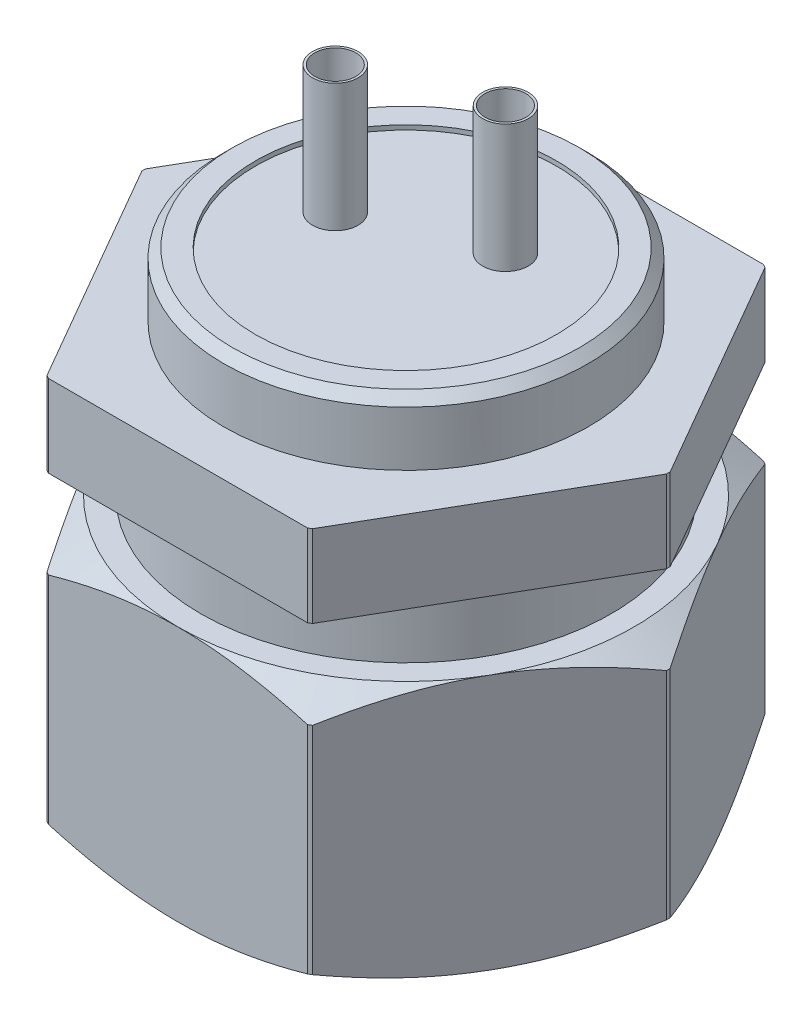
ISO-10303-21;
HEADER;
FILE_DESCRIPTION(('STEP AP214'),'2;1');
FILE_NAME('part.step','',(''),(''),'','','');
FILE_SCHEMA(('AUTOMOTIVE_DESIGN { 1 0 10303 214 1 1 1 1 }'));
ENDSEC;
DATA;
#1=APPLICATION_CONTEXT('core data for automotive mechanical design processes');
#2=APPLICATION_PROTOCOL_DEFINITION('international standard','automotive_design',2000,#1);
#3=PRODUCT_CONTEXT('',#1,'mechanical');
#4=PRODUCT('Part','Part','',(#3));
#5=PRODUCT_RELATED_PRODUCT_CATEGORY('part','',(#4));
#6=PRODUCT_DEFINITION_FORMATION('','',#4);
#7=PRODUCT_DEFINITION_CONTEXT('part definition',#1,'design');
#8=PRODUCT_DEFINITION('design','',#6,#7);
#9=PRODUCT_DEFINITION_SHAPE('','',#8);
#10=(LENGTH_UNIT() NAMED_UNIT(*) SI_UNIT(.MILLI.,.METRE.));
#11=(NAMED_UNIT(*) PLANE_ANGLE_UNIT() SI_UNIT($,.RADIAN.));
#12=(NAMED_UNIT(*) SI_UNIT($,.STERADIAN.) SOLID_ANGLE_UNIT());
#13=UNCERTAINTY_MEASURE_WITH_UNIT(LENGTH_MEASURE(1.E-05),#10,'distance_accuracy_value','');
#14=(GEOMETRIC_REPRESENTATION_CONTEXT(3) GLOBAL_UNCERTAINTY_ASSIGNED_CONTEXT((#13)) GLOBAL_UNIT_ASSIGNED_CONTEXT((#10,
#11,#12)) REPRESENTATION_CONTEXT('',''));
#15=CARTESIAN_POINT('',(0.,0.,0.));
#16=DIRECTION('',(0.,0.,1.));
#17=DIRECTION('',(1.,0.,0.));
#18=AXIS2_PLACEMENT_3D('',#15,#16,#17);
#19=CARTESIAN_POINT('',(-2.1,0.,0.55));
#20=DIRECTION('',(0.,-1.,0.));
#21=DIRECTION('',(0.,0.,-1.));
#22=AXIS2_PLACEMENT_3D('',#19,#20,#21);
#23=PLANE('',#22);
#24=CARTESIAN_POINT('',(-1.55,0.,0.));
#25=DIRECTION('',(0.,-1.,0.));
#26=DIRECTION('',(0.,0.,-1.));
#27=AXIS2_PLACEMENT_3D('',#24,#25,#26);
#28=CIRCLE('',#27,0.5);
#29=CARTESIAN_POINT('',(-1.55,0.,-0.499999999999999));
#30=VERTEX_POINT('',#29);
#31=EDGE_CURVE('E19',#30,#30,#28,.F.);
#32=ORIENTED_EDGE('',*,*,#31,.F.);
#33=EDGE_LOOP('',(#32));
#34=FACE_BOUND('',#33,.T.);
#35=ADVANCED_FACE('F16',(#34),#23,.T.);
#36=CARTESIAN_POINT('',(0.539999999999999,0.,-0.540000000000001));
#37=DIRECTION('',(0.,-1.,0.));
#38=DIRECTION('',(0.,0.,-1.));
#39=AXIS2_PLACEMENT_3D('',#36,#37,#38);
#40=PLANE('',#39);
#41=CARTESIAN_POINT('',(1.09,0.,-1.09));
#42=DIRECTION('',(0.,-1.,0.));
#43=DIRECTION('',(0.,0.,-1.));
#44=AXIS2_PLACEMENT_3D('',#41,#42,#43);
#45=CIRCLE('',#44,0.5);
#46=CARTESIAN_POINT('',(1.09,0.,-1.59));
#47=VERTEX_POINT('',#46);
#48=EDGE_CURVE('E490',#47,#47,#45,.F.);
#49=ORIENTED_EDGE('',*,*,#48,.F.);
#50=EDGE_LOOP('',(#49));
#51=FACE_BOUND('',#50,.T.);
#52=ADVANCED_FACE('F1023',(#51),#40,.T.);
#53=CARTESIAN_POINT('',(-1.55,0.,0.));
#54=DIRECTION('',(0.,-1.,0.));
#55=DIRECTION('',(0.,0.,-1.));
#56=AXIS2_PLACEMENT_3D('',#53,#54,#55);
#57=CYLINDRICAL_SURFACE('',#56,0.5);
#58=CARTESIAN_POINT('',(-1.55,-6.40000000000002,0.));
#59=DIRECTION('',(0.,-1.,0.));
#60=DIRECTION('',(1.,0.,0.));
#61=AXIS2_PLACEMENT_3D('',#58,#59,#60);
#62=CIRCLE('',#61,0.5);
#63=CARTESIAN_POINT('',(-1.05,-6.40000000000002,0.));
#64=VERTEX_POINT('',#63);
#65=EDGE_CURVE('E485',#64,#64,#62,.F.);
#66=ORIENTED_EDGE('',*,*,#65,.F.);
#67=EDGE_LOOP('',(#66));
#68=FACE_BOUND('',#67,.T.);
#69=ORIENTED_EDGE('',*,*,#31,.T.);
#70=EDGE_LOOP('',(#69));
#71=FACE_BOUND('',#70,.T.);
#72=ADVANCED_FACE('F1020',(#68,#71),#57,.F.);
#73=CARTESIAN_POINT('',(1.09,0.,-1.09));
#74=DIRECTION('',(0.,-1.,0.));
#75=DIRECTION('',(0.,0.,-1.));
#76=AXIS2_PLACEMENT_3D('',#73,#74,#75);
#77=CYLINDRICAL_SURFACE('',#76,0.5);
#78=CARTESIAN_POINT('',(1.09,-6.40000000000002,-1.09));
#79=DIRECTION('',(0.,-1.,0.));
#80=DIRECTION('',(1.,0.,0.));
#81=AXIS2_PLACEMENT_3D('',#78,#79,#80);
#82=CIRCLE('',#81,0.5);
#83=CARTESIAN_POINT('',(1.59,-6.40000000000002,-1.09));
#84=VERTEX_POINT('',#83);
#85=EDGE_CURVE('E479',#84,#84,#82,.F.);
#86=ORIENTED_EDGE('',*,*,#85,.F.);
#87=EDGE_LOOP('',(#86));
#88=FACE_BOUND('',#87,.T.);
#89=ORIENTED_EDGE('',*,*,#48,.T.);
#90=EDGE_LOOP('',(#89));
#91=FACE_BOUND('',#90,.T.);
#92=ADVANCED_FACE('F1031',(#88,#91),#77,.F.);
#93=CARTESIAN_POINT('',(-1.55,-6.40000000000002,0.));
#94=DIRECTION('',(0.,-1.,0.));
#95=DIRECTION('',(0.,0.,-1.));
#96=AXIS2_PLACEMENT_3D('',#93,#94,#95);
#97=CONICAL_SURFACE('',#96,0.5,0.785398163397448);
#98=CARTESIAN_POINT('',(-1.55,-6.59999999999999,0.));
#99=DIRECTION('',(0.,-1.,0.));
#100=DIRECTION('',(0.,0.,-1.));
#101=AXIS2_PLACEMENT_3D('',#98,#99,#100);
#102=CIRCLE('',#101,0.7);
#103=CARTESIAN_POINT('',(-1.55,-6.59999999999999,-0.699999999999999));
#104=VERTEX_POINT('',#103);
#105=EDGE_CURVE('E482',#104,#104,#102,.F.);
#106=ORIENTED_EDGE('',*,*,#105,.F.);
#107=EDGE_LOOP('',(#106));
#108=FACE_BOUND('',#107,.T.);
#109=ORIENTED_EDGE('',*,*,#65,.T.);
#110=EDGE_LOOP('',(#109));
#111=FACE_BOUND('',#110,.T.);
#112=ADVANCED_FACE('F1037',(#108,#111),#97,.F.);
#113=CARTESIAN_POINT('',(1.09,-6.40000000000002,-1.09));
#114=DIRECTION('',(0.,-1.,0.));
#115=DIRECTION('',(0.,0.,-1.));
#116=AXIS2_PLACEMENT_3D('',#113,#114,#115);
#117=CONICAL_SURFACE('',#116,0.5,0.785398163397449);
#118=CARTESIAN_POINT('',(1.09,-6.59999999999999,-1.09));
#119=DIRECTION('',(0.,-1.,0.));
#120=DIRECTION('',(0.,0.,-1.));
#121=AXIS2_PLACEMENT_3D('',#118,#119,#120);
#122=CIRCLE('',#121,0.7);
#123=CARTESIAN_POINT('',(1.09,-6.59999999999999,-1.79));
#124=VERTEX_POINT('',#123);
#125=EDGE_CURVE('E467',#124,#124,#122,.F.);
#126=ORIENTED_EDGE('',*,*,#125,.F.);
#127=EDGE_LOOP('',(#126));
#128=FACE_BOUND('',#127,.T.);
#129=ORIENTED_EDGE('',*,*,#85,.T.);
#130=EDGE_LOOP('',(#129));
#131=FACE_BOUND('',#130,.T.);
#132=ADVANCED_FACE('F1041',(#128,#131),#117,.F.);
#133=CARTESIAN_POINT('',(0.824999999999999,-6.92999999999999,-2.4));
#134=DIRECTION('',(0.,0.,-1.));
#135=DIRECTION('',(-1.,0.,0.));
#136=AXIS2_PLACEMENT_3D('',#133,#134,#135);
#137=PLANE('',#136);
#138=DIRECTION('',(-1.,0.,0.));
#139=VECTOR('',#138,1.);
#140=CARTESIAN_POINT('',(0.824999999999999,0.,-2.4));
#141=LINE('',#140,#139);
#142=CARTESIAN_POINT('',(-0.750000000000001,0.,-2.4));
#143=VERTEX_POINT('',#142);
#144=CARTESIAN_POINT('',(0.750000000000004,0.,-2.4));
#145=VERTEX_POINT('',#144);
#146=EDGE_CURVE('E251',#143,#145,#141,.F.);
#147=ORIENTED_EDGE('',*,*,#146,.T.);
#148=DIRECTION('',(0.,1.,0.));
#149=VECTOR('',#148,1.);
#150=CARTESIAN_POINT('',(0.750000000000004,-6.92999999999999,-2.4));
#151=LINE('',#150,#149);
#152=CARTESIAN_POINT('',(0.750000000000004,-6.59999999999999,-2.4));
#153=VERTEX_POINT('',#152);
#154=EDGE_CURVE('E463',#153,#145,#151,.T.);
#155=ORIENTED_EDGE('',*,*,#154,.F.);
#156=DIRECTION('',(1.,0.,0.));
#157=VECTOR('',#156,1.);
#158=CARTESIAN_POINT('',(-3.18863986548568,-6.59999999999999,-2.4));
#159=LINE('',#158,#157);
#160=CARTESIAN_POINT('',(-0.750000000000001,-6.59999999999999,-2.4));
#161=VERTEX_POINT('',#160);
#162=EDGE_CURVE('E469',#161,#153,#159,.T.);
#163=ORIENTED_EDGE('',*,*,#162,.F.);
#164=DIRECTION('',(0.,1.,0.));
#165=VECTOR('',#164,1.);
#166=CARTESIAN_POINT('',(-0.750000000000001,-6.92999999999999,-2.4));
#167=LINE('',#166,#165);
#168=EDGE_CURVE('E470',#143,#161,#167,.F.);
#169=ORIENTED_EDGE('',*,*,#168,.F.);
#170=EDGE_LOOP('',(#147,#155,#163,#169));
#171=FACE_BOUND('',#170,.T.);
#172=ADVANCED_FACE('F1045',(#171),#137,.T.);
#173=CARTESIAN_POINT('',(-0.749999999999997,-6.92999999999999,-2.37993305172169));
#174=DIRECTION('',(1.,0.,0.));
#175=DIRECTION('',(0.,0.,-1.));
#176=AXIS2_PLACEMENT_3D('',#173,#174,#175);
#177=PLANE('',#176);
#178=DIRECTION('',(0.,0.,-1.));
#179=VECTOR('',#178,1.);
#180=CARTESIAN_POINT('',(-0.750000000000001,0.,-2.37506124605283));
#181=LINE('',#180,#179);
#182=CARTESIAN_POINT('',(-0.749999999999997,0.,-2.80133896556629));
#183=VERTEX_POINT('',#182);
#184=EDGE_CURVE('E455',#143,#183,#181,.T.);
#185=ORIENTED_EDGE('',*,*,#184,.F.);
#186=ORIENTED_EDGE('',*,*,#168,.T.);
#187=DIRECTION('',(0.,0.,-1.));
#188=VECTOR('',#187,1.);
#189=CARTESIAN_POINT('',(-0.749999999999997,-6.59999999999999,3.18506694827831));
#190=LINE('',#189,#188);
#191=CARTESIAN_POINT('',(-0.749999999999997,-6.59999999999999,-2.80133896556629));
#192=VERTEX_POINT('',#191);
#193=EDGE_CURVE('E241',#192,#161,#190,.F.);
#194=ORIENTED_EDGE('',*,*,#193,.F.);
#195=DIRECTION('',(0.,-1.,0.));
#196=VECTOR('',#195,1.);
#197=CARTESIAN_POINT('',(-0.749999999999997,-4.05,-2.80133896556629));
#198=LINE('',#197,#196);
#199=CARTESIAN_POINT('',(-0.749999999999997,-1.5,-2.80133896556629));
#200=VERTEX_POINT('',#199);
#201=EDGE_CURVE('E452',#200,#192,#198,.T.);
#202=ORIENTED_EDGE('',*,*,#201,.F.);
#203=DIRECTION('',(0.,1.,0.));
#204=VECTOR('',#203,1.);
#205=CARTESIAN_POINT('',(-0.749999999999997,-6.92999999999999,-2.80133896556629));
#206=LINE('',#205,#204);
#207=EDGE_CURVE('E471',#200,#183,#206,.T.);
#208=ORIENTED_EDGE('',*,*,#207,.T.);
#209=EDGE_LOOP('',(#185,#186,#194,#202,#208));
#210=FACE_BOUND('',#209,.T.);
#211=ADVANCED_FACE('F1049',(#210),#177,.T.);
#212=CARTESIAN_POINT('',(-3.18863986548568,-6.59999999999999,3.18506694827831));
#213=DIRECTION('',(0.,-1.,0.));
#214=DIRECTION('',(0.,0.,-1.));
#215=AXIS2_PLACEMENT_3D('',#212,#213,#214);
#216=PLANE('',#215);
#217=ORIENTED_EDGE('',*,*,#125,.T.);
#218=EDGE_LOOP('',(#217));
#219=FACE_BOUND('',#218,.T.);
#220=ORIENTED_EDGE('',*,*,#105,.T.);
#221=EDGE_LOOP('',(#220));
#222=FACE_BOUND('',#221,.T.);
#223=DIRECTION('',(0.,0.,1.));
#224=VECTOR('',#223,1.);
#225=CARTESIAN_POINT('',(0.750000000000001,-6.59999999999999,-2.8214059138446));
#226=LINE('',#225,#224);
#227=CARTESIAN_POINT('',(0.750000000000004,-6.59999999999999,-2.80133896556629));
#228=VERTEX_POINT('',#227);
#229=EDGE_CURVE('E464',#228,#153,#226,.T.);
#230=ORIENTED_EDGE('',*,*,#229,.F.);
#231=CARTESIAN_POINT('',(0.,-6.59999999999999,0.));
#232=DIRECTION('',(0.,1.,0.));
#233=DIRECTION('',(0.,0.,1.));
#234=AXIS2_PLACEMENT_3D('',#231,#232,#233);
#235=CIRCLE('',#234,2.9);
#236=EDGE_CURVE('E451',#192,#228,#235,.T.);
#237=ORIENTED_EDGE('',*,*,#236,.F.);
#238=ORIENTED_EDGE('',*,*,#193,.T.);
#239=ORIENTED_EDGE('',*,*,#162,.T.);
#240=EDGE_LOOP('',(#230,#237,#238,#239));
#241=FACE_BOUND('',#240,.T.);
#242=ADVANCED_FACE('F1053',(#219,#222,#241),#216,.T.);
#243=CARTESIAN_POINT('',(0.750000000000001,-6.92999999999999,-2.8214059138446));
#244=DIRECTION('',(-1.,0.,0.));
#245=DIRECTION('',(0.,0.,1.));
#246=AXIS2_PLACEMENT_3D('',#243,#244,#245);
#247=PLANE('',#246);
#248=DIRECTION('',(0.,1.,0.));
#249=VECTOR('',#248,1.);
#250=CARTESIAN_POINT('',(0.750000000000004,-6.92999999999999,-2.80133896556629));
#251=LINE('',#250,#249);
#252=CARTESIAN_POINT('',(0.750000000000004,0.,-2.80133896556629));
#253=VERTEX_POINT('',#252);
#254=CARTESIAN_POINT('',(0.750000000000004,-1.5,-2.80133896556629));
#255=VERTEX_POINT('',#254);
#256=EDGE_CURVE('E460',#253,#255,#251,.F.);
#257=ORIENTED_EDGE('',*,*,#256,.T.);
#258=DIRECTION('',(0.,1.,0.));
#259=VECTOR('',#258,1.);
#260=CARTESIAN_POINT('',(0.750000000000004,-4.05,-2.80133896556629));
#261=LINE('',#260,#259);
#262=EDGE_CURVE('E446',#228,#255,#261,.T.);
#263=ORIENTED_EDGE('',*,*,#262,.F.);
#264=ORIENTED_EDGE('',*,*,#229,.T.);
#265=ORIENTED_EDGE('',*,*,#154,.T.);
#266=DIRECTION('',(0.,0.,-1.));
#267=VECTOR('',#266,1.);
#268=CARTESIAN_POINT('',(0.750000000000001,0.,-2.37506124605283));
#269=LINE('',#268,#267);
#270=EDGE_CURVE('E457',#253,#145,#269,.F.);
#271=ORIENTED_EDGE('',*,*,#270,.F.);
#272=EDGE_LOOP('',(#257,#263,#264,#265,#271));
#273=FACE_BOUND('',#272,.T.);
#274=ADVANCED_FACE('F1056',(#273),#247,.T.);
#275=CARTESIAN_POINT('',(-0.825000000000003,0.,-2.37506124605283));
#276=DIRECTION('',(0.,-1.,0.));
#277=DIRECTION('',(0.,0.,-1.));
#278=AXIS2_PLACEMENT_3D('',#275,#276,#277);
#279=PLANE('',#278);
#280=ORIENTED_EDGE('',*,*,#146,.F.);
#281=ORIENTED_EDGE('',*,*,#184,.T.);
#282=CARTESIAN_POINT('',(0.,0.,0.));
#283=DIRECTION('',(0.,-1.,0.));
#284=DIRECTION('',(0.,0.,-1.));
#285=AXIS2_PLACEMENT_3D('',#282,#283,#284);
#286=CIRCLE('',#285,2.9);
#287=EDGE_CURVE('E450',#253,#183,#286,.F.);
#288=ORIENTED_EDGE('',*,*,#287,.F.);
#289=ORIENTED_EDGE('',*,*,#270,.T.);
#290=EDGE_LOOP('',(#280,#281,#288,#289));
#291=FACE_BOUND('',#290,.T.);
#292=ADVANCED_FACE('F1060',(#291),#279,.T.);
#293=CARTESIAN_POINT('',(0.,-1.5,0.));
#294=DIRECTION('',(0.,1.,0.));
#295=DIRECTION('',(0.,0.,1.));
#296=AXIS2_PLACEMENT_3D('',#293,#294,#295);
#297=CYLINDRICAL_SURFACE('',#296,2.9);
#298=ORIENTED_EDGE('',*,*,#262,.T.);
#299=CARTESIAN_POINT('',(0.,-1.5,0.));
#300=DIRECTION('',(0.,1.,0.));
#301=DIRECTION('',(0.,0.,1.));
#302=AXIS2_PLACEMENT_3D('',#299,#300,#301);
#303=CIRCLE('',#302,2.9);
#304=EDGE_CURVE('E999',#200,#255,#303,.T.);
#305=ORIENTED_EDGE('',*,*,#304,.F.);
#306=ORIENTED_EDGE('',*,*,#201,.T.);
#307=ORIENTED_EDGE('',*,*,#236,.T.);
#308=EDGE_LOOP('',(#298,#305,#306,#307));
#309=FACE_BOUND('',#308,.T.);
#310=ADVANCED_FACE('F1064',(#309),#297,.T.);
#311=CARTESIAN_POINT('',(0.,0.,0.));
#312=DIRECTION('',(0.,-1.,0.));
#313=DIRECTION('',(0.,0.,-1.));
#314=AXIS2_PLACEMENT_3D('',#311,#312,#313);
#315=CYLINDRICAL_SURFACE('',#314,2.9);
#316=ORIENTED_EDGE('',*,*,#287,.T.);
#317=ORIENTED_EDGE('',*,*,#207,.F.);
#318=CARTESIAN_POINT('',(0.,-1.5,0.));
#319=DIRECTION('',(0.,-1.,0.));
#320=DIRECTION('',(0.,0.,-1.));
#321=AXIS2_PLACEMENT_3D('',#318,#319,#320);
#322=CIRCLE('',#321,2.9);
#323=EDGE_CURVE('E995',#255,#200,#322,.F.);
#324=ORIENTED_EDGE('',*,*,#323,.F.);
#325=ORIENTED_EDGE('',*,*,#256,.F.);
#326=EDGE_LOOP('',(#316,#317,#324,#325));
#327=FACE_BOUND('',#326,.T.);
#328=ADVANCED_FACE('F1067',(#327),#315,.F.);
#329=CARTESIAN_POINT('',(-3.85,-1.5,3.85));
#330=DIRECTION('',(0.,-1.,0.));
#331=DIRECTION('',(0.,0.,-1.));
#332=AXIS2_PLACEMENT_3D('',#329,#330,#331);
#333=PLANE('',#332);
#334=ORIENTED_EDGE('',*,*,#304,.T.);
#335=ORIENTED_EDGE('',*,*,#323,.T.);
#336=EDGE_LOOP('',(#334,#335));
#337=FACE_BOUND('',#336,.T.);
#338=CARTESIAN_POINT('',(0.,-1.5,0.));
#339=DIRECTION('',(0.,1.,0.));
#340=DIRECTION('',(-1.,0.,0.));
#341=AXIS2_PLACEMENT_3D('',#338,#339,#340);
#342=CIRCLE('',#341,3.5);
#343=CARTESIAN_POINT('',(-3.5,-1.5,0.));
#344=VERTEX_POINT('',#343);
#345=EDGE_CURVE('E991',#344,#344,#342,.T.);
#346=ORIENTED_EDGE('',*,*,#345,.F.);
#347=EDGE_LOOP('',(#346));
#348=FACE_BOUND('',#347,.T.);
#349=ADVANCED_FACE('F1071',(#337,#348),#333,.T.);
#350=CARTESIAN_POINT('',(0.,-3.30000000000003,0.));
#351=DIRECTION('',(0.,1.,0.));
#352=DIRECTION('',(-1.,0.,0.));
#353=AXIS2_PLACEMENT_3D('',#350,#351,#352);
#354=CYLINDRICAL_SURFACE('',#353,3.5);
#355=ORIENTED_EDGE('',*,*,#345,.T.);
#356=EDGE_LOOP('',(#355));
#357=FACE_BOUND('',#356,.T.);
#358=CARTESIAN_POINT('',(0.,-3.30000000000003,0.));
#359=DIRECTION('',(0.,1.,0.));
#360=DIRECTION('',(-1.,0.,0.));
#361=AXIS2_PLACEMENT_3D('',#358,#359,#360);
#362=CIRCLE('',#361,3.5);
#363=CARTESIAN_POINT('',(-3.5,-3.30000000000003,0.));
#364=VERTEX_POINT('',#363);
#365=EDGE_CURVE('E987',#364,#364,#362,.T.);
#366=ORIENTED_EDGE('',*,*,#365,.F.);
#367=EDGE_LOOP('',(#366));
#368=FACE_BOUND('',#367,.T.);
#369=ADVANCED_FACE('F1075',(#357,#368),#354,.F.);
#370=CARTESIAN_POINT('',(-4.73,-3.30000000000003,4.73));
#371=DIRECTION('',(0.,-1.,0.));
#372=DIRECTION('',(0.,0.,-1.));
#373=AXIS2_PLACEMENT_3D('',#370,#371,#372);
#374=PLANE('',#373);
#375=ORIENTED_EDGE('',*,*,#365,.T.);
#376=EDGE_LOOP('',(#375));
#377=FACE_BOUND('',#376,.T.);
#378=CARTESIAN_POINT('',(0.,-3.30000000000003,0.));
#379=DIRECTION('',(0.,1.,0.));
#380=DIRECTION('',(-1.,0.,0.));
#381=AXIS2_PLACEMENT_3D('',#378,#379,#380);
#382=CIRCLE('',#381,4.3);
#383=CARTESIAN_POINT('',(-4.3,-3.30000000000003,0.));
#384=VERTEX_POINT('',#383);
#385=EDGE_CURVE('E443',#384,#384,#382,.T.);
#386=ORIENTED_EDGE('',*,*,#385,.F.);
#387=EDGE_LOOP('',(#386));
#388=FACE_BOUND('',#387,.T.);
#389=ADVANCED_FACE('F1079',(#377,#388),#374,.T.);
#390=CARTESIAN_POINT('',(0.,-3.09999999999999,0.));
#391=DIRECTION('',(0.,1.,0.));
#392=DIRECTION('',(-1.,0.,0.));
#393=AXIS2_PLACEMENT_3D('',#390,#391,#392);
#394=CONICAL_SURFACE('',#393,4.5,0.785398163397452);
#395=ORIENTED_EDGE('',*,*,#385,.T.);
#396=EDGE_LOOP('',(#395));
#397=FACE_BOUND('',#396,.T.);
#398=CARTESIAN_POINT('',(0.,-3.09999999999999,0.));
#399=DIRECTION('',(0.,1.,0.));
#400=DIRECTION('',(0.,0.,1.));
#401=AXIS2_PLACEMENT_3D('',#398,#399,#400);
#402=CIRCLE('',#401,4.5);
#403=CARTESIAN_POINT('',(0.,-3.09999999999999,4.5));
#404=VERTEX_POINT('',#403);
#405=EDGE_CURVE('E439',#404,#404,#402,.T.);
#406=ORIENTED_EDGE('',*,*,#405,.F.);
#407=EDGE_LOOP('',(#406));
#408=FACE_BOUND('',#407,.T.);
#409=ADVANCED_FACE('F1083',(#397,#408),#394,.T.);
#410=CARTESIAN_POINT('',(0.,-7.1,0.));
#411=DIRECTION('',(0.,1.,0.));
#412=DIRECTION('',(0.,0.,1.));
#413=AXIS2_PLACEMENT_3D('',#410,#411,#412);
#414=CYLINDRICAL_SURFACE('',#413,4.5);
#415=ORIENTED_EDGE('',*,*,#405,.T.);
#416=EDGE_LOOP('',(#415));
#417=FACE_BOUND('',#416,.T.);
#418=CARTESIAN_POINT('',(0.,-7.1,0.));
#419=DIRECTION('',(0.,1.,0.));
#420=DIRECTION('',(0.,0.,1.));
#421=AXIS2_PLACEMENT_3D('',#418,#419,#420);
#422=CIRCLE('',#421,4.5);
#423=CARTESIAN_POINT('',(0.,-7.1,4.5));
#424=VERTEX_POINT('',#423);
#425=EDGE_CURVE('E438',#424,#424,#422,.T.);
#426=ORIENTED_EDGE('',*,*,#425,.F.);
#427=EDGE_LOOP('',(#426));
#428=FACE_BOUND('',#427,.T.);
#429=ADVANCED_FACE('F1087',(#417,#428),#414,.F.);
#430=CARTESIAN_POINT('',(-5.49069487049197,-7.1,5.5));
#431=DIRECTION('',(0.,-1.,0.));
#432=DIRECTION('',(0.,0.,-1.));
#433=AXIS2_PLACEMENT_3D('',#430,#431,#432);
#434=PLANE('',#433);
#435=ORIENTED_EDGE('',*,*,#425,.T.);
#436=EDGE_LOOP('',(#435));
#437=FACE_BOUND('',#436,.T.);
#438=CARTESIAN_POINT('',(0.,-7.1,0.));
#439=DIRECTION('',(0.,1.,0.));
#440=DIRECTION('',(-1.,0.,0.));
#441=AXIS2_PLACEMENT_3D('',#438,#439,#440);
#442=CIRCLE('',#441,5.);
#443=CARTESIAN_POINT('',(4.3301270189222,-7.1,-2.5));
#444=VERTEX_POINT('',#443);
#445=CARTESIAN_POINT('',(0.,-7.1,-5.));
#446=VERTEX_POINT('',#445);
#447=EDGE_CURVE('E425',#444,#446,#442,.T.);
#448=ORIENTED_EDGE('',*,*,#447,.F.);
#449=CARTESIAN_POINT('',(0.,-7.1,0.));
#450=DIRECTION('',(0.,1.,0.));
#451=DIRECTION('',(-1.,0.,0.));
#452=AXIS2_PLACEMENT_3D('',#449,#450,#451);
#453=CIRCLE('',#452,5.);
#454=CARTESIAN_POINT('',(4.33012701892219,-7.1,2.5));
#455=VERTEX_POINT('',#454);
#456=EDGE_CURVE('E431',#455,#444,#453,.T.);
#457=ORIENTED_EDGE('',*,*,#456,.F.);
#458=CARTESIAN_POINT('',(0.,-7.1,0.));
#459=DIRECTION('',(0.,1.,0.));
#460=DIRECTION('',(0.,0.,1.));
#461=AXIS2_PLACEMENT_3D('',#458,#459,#460);
#462=CIRCLE('',#461,5.);
#463=CARTESIAN_POINT('',(0.,-7.1,5.));
#464=VERTEX_POINT('',#463);
#465=EDGE_CURVE('E414',#464,#455,#462,.T.);
#466=ORIENTED_EDGE('',*,*,#465,.F.);
#467=CARTESIAN_POINT('',(0.,-7.1,0.));
#468=DIRECTION('',(0.,1.,0.));
#469=DIRECTION('',(0.,0.,1.));
#470=AXIS2_PLACEMENT_3D('',#467,#468,#469);
#471=CIRCLE('',#470,5.);
#472=CARTESIAN_POINT('',(-4.3301270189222,-7.1,2.5));
#473=VERTEX_POINT('',#472);
#474=EDGE_CURVE('E407',#473,#464,#471,.T.);
#475=ORIENTED_EDGE('',*,*,#474,.F.);
#476=CARTESIAN_POINT('',(0.,-7.1,0.));
#477=DIRECTION('',(0.,1.,0.));
#478=DIRECTION('',(-1.,0.,0.));
#479=AXIS2_PLACEMENT_3D('',#476,#477,#478);
#480=CIRCLE('',#479,5.);
#481=CARTESIAN_POINT('',(-4.3301270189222,-7.1,-2.50000000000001));
#482=VERTEX_POINT('',#481);
#483=EDGE_CURVE('E417',#482,#473,#480,.T.);
#484=ORIENTED_EDGE('',*,*,#483,.F.);
#485=CARTESIAN_POINT('',(0.,-7.1,0.));
#486=DIRECTION('',(0.,1.,0.));
#487=DIRECTION('',(-1.,0.,0.));
#488=AXIS2_PLACEMENT_3D('',#485,#486,#487);
#489=CIRCLE('',#488,5.);
#490=EDGE_CURVE('E420',#446,#482,#489,.T.);
#491=ORIENTED_EDGE('',*,*,#490,.F.);
#492=EDGE_LOOP('',(#448,#457,#466,#475,#484,#491));
#493=FACE_BOUND('',#492,.T.);
#494=ADVANCED_FACE('F1090',(#437,#493),#434,.T.);
#495=CARTESIAN_POINT('',(0.,-1.93301270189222,0.));
#496=DIRECTION('',(0.,1.,0.));
#497=DIRECTION('',(0.,0.,1.));
#498=AXIS2_PLACEMENT_3D('',#495,#496,#497);
#499=CYLINDRICAL_SURFACE('',#498,5.75);
#500=DIRECTION('',(0.,1.,0.));
#501=VECTOR('',#500,1.);
#502=CARTESIAN_POINT('',(5.74985410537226,-7.38,0.0409605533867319));
#503=LINE('',#502,#501);
#504=CARTESIAN_POINT('',(5.74985410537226,-6.66698729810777,0.0409605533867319));
#505=VERTEX_POINT('',#504);
#506=CARTESIAN_POINT('',(5.74985410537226,-1.93301270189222,0.0409605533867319));
#507=VERTEX_POINT('',#506);
#508=EDGE_CURVE('E400',#505,#507,#503,.T.);
#509=ORIENTED_EDGE('',*,*,#508,.F.);
#510=CARTESIAN_POINT('',(0.,-6.66698729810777,0.));
#511=DIRECTION('',(0.,1.,0.));
#512=DIRECTION('',(0.,0.,1.));
#513=AXIS2_PLACEMENT_3D('',#510,#511,#512);
#514=CIRCLE('',#513,5.75);
#515=CARTESIAN_POINT('',(5.74985410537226,-6.66698729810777,-0.0409605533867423));
#516=VERTEX_POINT('',#515);
#517=EDGE_CURVE('E432',#516,#505,#514,.F.);
#518=ORIENTED_EDGE('',*,*,#517,.F.);
#519=DIRECTION('',(0.,1.,0.));
#520=VECTOR('',#519,1.);
#521=CARTESIAN_POINT('',(5.74985410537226,-7.38,-0.0409605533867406));
#522=LINE('',#521,#520);
#523=CARTESIAN_POINT('',(5.74985410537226,-1.93301270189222,-0.0409605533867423));
#524=VERTEX_POINT('',#523);
#525=EDGE_CURVE('E386',#524,#516,#522,.F.);
#526=ORIENTED_EDGE('',*,*,#525,.F.);
#527=CARTESIAN_POINT('',(0.,-1.93301270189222,0.));
#528=DIRECTION('',(0.,1.,0.));
#529=DIRECTION('',(0.,0.,1.));
#530=AXIS2_PLACEMENT_3D('',#527,#528,#529);
#531=CIRCLE('',#530,5.75);
#532=EDGE_CURVE('E435',#524,#507,#531,.F.);
#533=ORIENTED_EDGE('',*,*,#532,.T.);
#534=EDGE_LOOP('',(#509,#518,#526,#533));
#535=FACE_BOUND('',#534,.T.);
#536=ADVANCED_FACE('F962',(#535),#499,.T.);
#537=CARTESIAN_POINT('',(0.,-6.66698729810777,0.));
#538=DIRECTION('',(0.,1.,0.));
#539=DIRECTION('',(-1.,0.,0.));
#540=AXIS2_PLACEMENT_3D('',#537,#538,#539);
#541=CONICAL_SURFACE('',#540,5.75,1.0471975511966);
#542=CARTESIAN_POINT('',(4.33012701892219,-7.1,2.5));
#543=CARTESIAN_POINT('',(4.3903556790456,-7.10001911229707,2.39568090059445));
#544=CARTESIAN_POINT('',(4.45058161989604,-7.09748725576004,2.29136651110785));
#545=CARTESIAN_POINT('',(4.5709195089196,-7.0874635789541,2.08293517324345));
#546=CARTESIAN_POINT('',(4.63103147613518,-7.07997267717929,1.97881819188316));
#547=CARTESIAN_POINT('',(4.75076240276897,-7.06022109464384,1.77143814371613));
#548=CARTESIAN_POINT('',(4.81038233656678,-7.04798386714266,1.66817338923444));
#549=CARTESIAN_POINT('',(4.92934645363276,-7.01899522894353,1.46212149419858));
#550=CARTESIAN_POINT('',(4.98869063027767,-7.00224371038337,1.35933436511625));
#551=CARTESIAN_POINT('',(5.16607271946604,-6.94571867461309,1.05209957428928));
#552=CARTESIAN_POINT('',(5.28360943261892,-6.89964864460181,0.848520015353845));
#553=CARTESIAN_POINT('',(5.51769112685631,-6.79329361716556,0.443078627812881));
#554=CARTESIAN_POINT('',(5.63422830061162,-6.73293926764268,0.241230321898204));
#555=CARTESIAN_POINT('',(5.74985410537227,-6.66698729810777,0.0409605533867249));
#556=B_SPLINE_CURVE_WITH_KNOTS('',3,(#542,#543,#544,#545,#546,#547,#548,#549,#550,#551,#552,
#553,#554,#555),.UNSPECIFIED.,.F.,.F.,(4,2,2,2,2,2,4),(0.,0.361336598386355,0.722606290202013,
1.08211310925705,1.44162851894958,2.15976280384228,2.88145795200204),.UNSPECIFIED.);
#557=EDGE_CURVE('E404',#455,#505,#556,.T.);
#558=ORIENTED_EDGE('',*,*,#557,.F.);
#559=ORIENTED_EDGE('',*,*,#456,.T.);
#560=CARTESIAN_POINT('',(5.74985410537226,-6.66698729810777,-0.0409605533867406));
#561=CARTESIAN_POINT('',(5.63422830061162,-6.73293926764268,-0.241230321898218));
#562=CARTESIAN_POINT('',(5.51769112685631,-6.79329361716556,-0.443078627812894));
#563=CARTESIAN_POINT('',(5.28360943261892,-6.89964864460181,-0.848520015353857));
#564=CARTESIAN_POINT('',(5.16607271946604,-6.94571867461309,-1.05209957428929));
#565=CARTESIAN_POINT('',(4.98869063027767,-7.00224371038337,-1.35933436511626));
#566=CARTESIAN_POINT('',(4.92934645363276,-7.01899522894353,-1.46212149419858));
#567=CARTESIAN_POINT('',(4.81038233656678,-7.04798386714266,-1.66817338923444));
#568=CARTESIAN_POINT('',(4.75076240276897,-7.06022109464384,-1.77143814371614));
#569=CARTESIAN_POINT('',(4.63103147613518,-7.07997267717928,-1.97881819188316));
#570=CARTESIAN_POINT('',(4.57091950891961,-7.0874635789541,-2.08293517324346));
#571=CARTESIAN_POINT('',(4.45058161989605,-7.09748725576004,-2.29136651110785));
#572=CARTESIAN_POINT('',(4.39035567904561,-7.10001911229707,-2.39568090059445));
#573=CARTESIAN_POINT('',(4.3301270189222,-7.1,-2.5));
#574=B_SPLINE_CURVE_WITH_KNOTS('',3,(#560,#561,#562,#563,#564,#565,#566,#567,#568,#569,#570,
#571,#572,#573),.UNSPECIFIED.,.F.,.F.,(4,2,2,2,2,2,4),(0.,0.721695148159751,1.43982943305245,
1.79934484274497,2.15885166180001,2.52012135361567,2.88145795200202),.UNSPECIFIED.);
#575=EDGE_CURVE('E390',#516,#444,#574,.T.);
#576=ORIENTED_EDGE('',*,*,#575,.F.);
#577=ORIENTED_EDGE('',*,*,#517,.T.);
#578=EDGE_LOOP('',(#558,#559,#576,#577));
#579=FACE_BOUND('',#578,.T.);
#580=ADVANCED_FACE('F958',(#579),#541,.T.);
#581=CARTESIAN_POINT('',(0.,-1.93301270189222,0.));
#582=DIRECTION('',(0.,1.,0.));
#583=DIRECTION('',(0.,0.,1.));
#584=AXIS2_PLACEMENT_3D('',#581,#582,#583);
#585=CYLINDRICAL_SURFACE('',#584,5.75);
#586=DIRECTION('',(0.,1.,0.));
#587=VECTOR('',#586,1.);
#588=CARTESIAN_POINT('',(2.91039993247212,-7.38,-4.95903944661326));
#589=LINE('',#588,#587);
#590=CARTESIAN_POINT('',(2.91039993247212,-6.66698729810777,-4.95903944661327));
#591=VERTEX_POINT('',#590);
#592=CARTESIAN_POINT('',(2.91039993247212,-1.93301270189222,-4.95903944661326));
#593=VERTEX_POINT('',#592);
#594=EDGE_CURVE('E391',#591,#593,#589,.T.);
#595=ORIENTED_EDGE('',*,*,#594,.F.);
#596=CARTESIAN_POINT('',(0.,-6.66698729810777,0.));
#597=DIRECTION('',(0.,1.,0.));
#598=DIRECTION('',(0.,0.,1.));
#599=AXIS2_PLACEMENT_3D('',#596,#597,#598);
#600=CIRCLE('',#599,5.75000000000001);
#601=CARTESIAN_POINT('',(2.83945417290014,-6.66698729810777,-5.));
#602=VERTEX_POINT('',#601);
#603=EDGE_CURVE('E426',#602,#591,#600,.F.);
#604=ORIENTED_EDGE('',*,*,#603,.F.);
#605=DIRECTION('',(0.,1.,0.));
#606=VECTOR('',#605,1.);
#607=CARTESIAN_POINT('',(2.83945417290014,-7.38,-5.00000000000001));
#608=LINE('',#607,#606);
#609=CARTESIAN_POINT('',(2.83945417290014,-1.93301270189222,-5.00000000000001));
#610=VERTEX_POINT('',#609);
#611=EDGE_CURVE('E378',#610,#602,#608,.F.);
#612=ORIENTED_EDGE('',*,*,#611,.F.);
#613=CARTESIAN_POINT('',(0.,-1.93301270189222,0.));
#614=DIRECTION('',(0.,1.,0.));
#615=DIRECTION('',(0.,0.,1.));
#616=AXIS2_PLACEMENT_3D('',#613,#614,#615);
#617=CIRCLE('',#616,5.75);
#618=EDGE_CURVE('E428',#610,#593,#617,.F.);
#619=ORIENTED_EDGE('',*,*,#618,.T.);
#620=EDGE_LOOP('',(#595,#604,#612,#619));
#621=FACE_BOUND('',#620,.T.);
#622=ADVANCED_FACE('F945',(#621),#585,.T.);
#623=CARTESIAN_POINT('',(0.,-6.66698729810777,0.));
#624=DIRECTION('',(0.,1.,0.));
#625=DIRECTION('',(-1.,0.,0.));
#626=AXIS2_PLACEMENT_3D('',#623,#624,#625);
#627=CONICAL_SURFACE('',#626,5.75,1.0471975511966);
#628=CARTESIAN_POINT('',(4.33012701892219,-7.1,-2.5));
#629=CARTESIAN_POINT('',(4.26989835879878,-7.10001911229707,-2.60431909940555));
#630=CARTESIAN_POINT('',(4.20967241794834,-7.09748725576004,-2.70863348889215));
#631=CARTESIAN_POINT('',(4.08933452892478,-7.0874635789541,-2.91706482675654));
#632=CARTESIAN_POINT('',(4.0292225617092,-7.07997267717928,-3.02118180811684));
#633=CARTESIAN_POINT('',(3.90949163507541,-7.06022109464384,-3.22856185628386));
#634=CARTESIAN_POINT('',(3.84987170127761,-7.04798386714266,-3.33182661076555));
#635=CARTESIAN_POINT('',(3.73090758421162,-7.01899522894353,-3.53787850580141));
#636=CARTESIAN_POINT('',(3.67156340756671,-7.00224371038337,-3.64066563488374));
#637=CARTESIAN_POINT('',(3.49418131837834,-6.94571867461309,-3.94790042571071));
#638=CARTESIAN_POINT('',(3.37664460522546,-6.89964864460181,-4.15147998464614));
#639=CARTESIAN_POINT('',(3.14256291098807,-6.79329361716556,-4.55692137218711));
#640=CARTESIAN_POINT('',(3.02602573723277,-6.73293926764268,-4.75876967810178));
#641=CARTESIAN_POINT('',(2.91039993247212,-6.66698729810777,-4.95903944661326));
#642=B_SPLINE_CURVE_WITH_KNOTS('',3,(#628,#629,#630,#631,#632,#633,#634,#635,#636,#637,#638,
#639,#640,#641),.UNSPECIFIED.,.F.,.F.,(4,2,2,2,2,2,4),(0.,0.361336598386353,0.722606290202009,
1.08211310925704,1.44162851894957,2.15976280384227,2.88145795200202),.UNSPECIFIED.);
#643=EDGE_CURVE('E395',#444,#591,#642,.T.);
#644=ORIENTED_EDGE('',*,*,#643,.F.);
#645=ORIENTED_EDGE('',*,*,#447,.T.);
#646=CARTESIAN_POINT('',(2.83945417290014,-6.66698729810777,-5.));
#647=CARTESIAN_POINT('',(2.60820256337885,-6.73293926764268,-5.));
#648=CARTESIAN_POINT('',(2.37512821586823,-6.79329361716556,-5.));
#649=CARTESIAN_POINT('',(1.90696482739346,-6.89964864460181,-5.));
#650=CARTESIAN_POINT('',(1.6718914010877,-6.94571867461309,-5.));
#651=CARTESIAN_POINT('',(1.31712722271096,-7.00224371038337,-5.));
#652=CARTESIAN_POINT('',(1.19843886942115,-7.01899522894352,-5.));
#653=CARTESIAN_POINT('',(0.960510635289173,-7.04798386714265,-5.));
#654=CARTESIAN_POINT('',(0.841270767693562,-7.06022109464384,-5.));
#655=CARTESIAN_POINT('',(0.601808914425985,-7.07997267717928,-5.));
#656=CARTESIAN_POINT('',(0.481584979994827,-7.08746357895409,-5.00000000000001));
#657=CARTESIAN_POINT('',(0.240909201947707,-7.09748725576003,-5.));
#658=CARTESIAN_POINT('',(0.120457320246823,-7.10001911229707,-5.));
#659=CARTESIAN_POINT('',(0.,-7.1,-5.));
#660=B_SPLINE_CURVE_WITH_KNOTS('',3,(#646,#647,#648,#649,#650,#651,#652,#653,#654,#655,#656,
#657,#658,#659),.UNSPECIFIED.,.F.,.F.,(4,2,2,2,2,2,4),(0.,0.72169514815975,1.43982943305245,
1.79934484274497,2.15885166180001,2.52012135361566,2.88145795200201),.UNSPECIFIED.);
#661=EDGE_CURVE('E381',#602,#446,#660,.T.);
#662=ORIENTED_EDGE('',*,*,#661,.F.);
#663=ORIENTED_EDGE('',*,*,#603,.T.);
#664=EDGE_LOOP('',(#644,#645,#662,#663));
#665=FACE_BOUND('',#664,.T.);
#666=ADVANCED_FACE('F939',(#665),#627,.T.);
#667=CARTESIAN_POINT('',(0.,-1.93301270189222,0.));
#668=DIRECTION('',(0.,1.,0.));
#669=DIRECTION('',(0.,0.,1.));
#670=AXIS2_PLACEMENT_3D('',#667,#668,#669);
#671=CYLINDRICAL_SURFACE('',#670,5.75);
#672=DIRECTION('',(0.,1.,0.));
#673=VECTOR('',#672,1.);
#674=CARTESIAN_POINT('',(-2.83945417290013,-7.38,-5.));
#675=LINE('',#674,#673);
#676=CARTESIAN_POINT('',(-2.83945417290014,-6.66698729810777,-5.));
#677=VERTEX_POINT('',#676);
#678=CARTESIAN_POINT('',(-2.83945417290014,-1.93301270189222,-5.));
#679=VERTEX_POINT('',#678);
#680=EDGE_CURVE('E382',#677,#679,#675,.T.);
#681=ORIENTED_EDGE('',*,*,#680,.F.);
#682=CARTESIAN_POINT('',(0.,-6.66698729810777,0.));
#683=DIRECTION('',(0.,1.,0.));
#684=DIRECTION('',(0.,0.,1.));
#685=AXIS2_PLACEMENT_3D('',#682,#683,#684);
#686=CIRCLE('',#685,5.75);
#687=CARTESIAN_POINT('',(-2.91039993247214,-6.66698729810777,-4.95903944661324));
#688=VERTEX_POINT('',#687);
#689=EDGE_CURVE('E421',#688,#677,#686,.F.);
#690=ORIENTED_EDGE('',*,*,#689,.F.);
#691=DIRECTION('',(0.,1.,0.));
#692=VECTOR('',#691,1.);
#693=CARTESIAN_POINT('',(-2.91039993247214,-7.38,-4.95903944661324));
#694=LINE('',#693,#692);
#695=CARTESIAN_POINT('',(-2.91039993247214,-1.93301270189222,-4.95903944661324));
#696=VERTEX_POINT('',#695);
#697=EDGE_CURVE('E370',#696,#688,#694,.F.);
#698=ORIENTED_EDGE('',*,*,#697,.F.);
#699=CARTESIAN_POINT('',(0.,-1.93301270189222,0.));
#700=DIRECTION('',(0.,1.,0.));
#701=DIRECTION('',(0.,0.,1.));
#702=AXIS2_PLACEMENT_3D('',#699,#700,#701);
#703=CIRCLE('',#702,5.75);
#704=EDGE_CURVE('E423',#696,#679,#703,.F.);
#705=ORIENTED_EDGE('',*,*,#704,.T.);
#706=EDGE_LOOP('',(#681,#690,#698,#705));
#707=FACE_BOUND('',#706,.T.);
#708=ADVANCED_FACE('F944',(#707),#671,.T.);
#709=CARTESIAN_POINT('',(0.,-6.66698729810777,0.));
#710=DIRECTION('',(0.,1.,0.));
#711=DIRECTION('',(-1.,0.,0.));
#712=AXIS2_PLACEMENT_3D('',#709,#710,#711);
#713=CONICAL_SURFACE('',#712,5.75,1.0471975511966);
#714=CARTESIAN_POINT('',(0.,-7.1,-5.));
#715=CARTESIAN_POINT('',(-0.120457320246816,-7.10001911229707,-5.));
#716=CARTESIAN_POINT('',(-0.240909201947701,-7.09748725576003,-5.));
#717=CARTESIAN_POINT('',(-0.481584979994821,-7.08746357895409,-5.00000000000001));
#718=CARTESIAN_POINT('',(-0.601808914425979,-7.07997267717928,-5.));
#719=CARTESIAN_POINT('',(-0.841270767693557,-7.06022109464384,-5.));
#720=CARTESIAN_POINT('',(-0.960510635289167,-7.04798386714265,-5.));
#721=CARTESIAN_POINT('',(-1.19843886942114,-7.01899522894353,-5.));
#722=CARTESIAN_POINT('',(-1.31712722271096,-7.00224371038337,-5.));
#723=CARTESIAN_POINT('',(-1.6718914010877,-6.94571867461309,-5.));
#724=CARTESIAN_POINT('',(-1.90696482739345,-6.89964864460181,-5.));
#725=CARTESIAN_POINT('',(-2.37512821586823,-6.79329361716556,-5.));
#726=CARTESIAN_POINT('',(-2.60820256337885,-6.73293926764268,-5.));
#727=CARTESIAN_POINT('',(-2.83945417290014,-6.66698729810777,-5.));
#728=B_SPLINE_CURVE_WITH_KNOTS('',3,(#714,#715,#716,#717,#718,#719,#720,#721,#722,#723,#724,
#725,#726,#727),.UNSPECIFIED.,.F.,.F.,(4,2,2,2,2,2,4),(0.,0.361336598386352,0.722606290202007,
1.08211310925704,1.44162851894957,2.15976280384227,2.88145795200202),.UNSPECIFIED.);
#729=EDGE_CURVE('E385',#446,#677,#728,.T.);
#730=ORIENTED_EDGE('',*,*,#729,.F.);
#731=ORIENTED_EDGE('',*,*,#490,.T.);
#732=CARTESIAN_POINT('',(-2.91039993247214,-6.66698729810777,-4.95903944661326));
#733=CARTESIAN_POINT('',(-3.02602573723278,-6.73293926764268,-4.75876967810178));
#734=CARTESIAN_POINT('',(-3.14256291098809,-6.79329361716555,-4.55692137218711));
#735=CARTESIAN_POINT('',(-3.37664460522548,-6.89964864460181,-4.15147998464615));
#736=CARTESIAN_POINT('',(-3.49418131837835,-6.94571867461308,-3.94790042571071));
#737=CARTESIAN_POINT('',(-3.67156340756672,-7.00224371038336,-3.64066563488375));
#738=CARTESIAN_POINT('',(-3.73090758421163,-7.01899522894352,-3.53787850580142));
#739=CARTESIAN_POINT('',(-3.84987170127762,-7.04798386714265,-3.33182661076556));
#740=CARTESIAN_POINT('',(-3.90949163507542,-7.06022109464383,-3.22856185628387));
#741=CARTESIAN_POINT('',(-4.02922256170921,-7.07997267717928,-3.02118180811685));
#742=CARTESIAN_POINT('',(-4.08933452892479,-7.08746357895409,-2.91706482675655));
#743=CARTESIAN_POINT('',(-4.20967241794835,-7.09748725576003,-2.70863348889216));
#744=CARTESIAN_POINT('',(-4.26989835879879,-7.10001911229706,-2.60431909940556));
#745=CARTESIAN_POINT('',(-4.3301270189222,-7.1,-2.50000000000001));
#746=B_SPLINE_CURVE_WITH_KNOTS('',3,(#732,#733,#734,#735,#736,#737,#738,#739,#740,#741,#742,
#743,#744,#745),.UNSPECIFIED.,.F.,.F.,(4,2,2,2,2,2,4),(0.,0.721695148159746,1.43982943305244,
1.79934484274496,2.1588516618,2.52012135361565,2.881457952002),.UNSPECIFIED.);
#747=EDGE_CURVE('E373',#688,#482,#746,.T.);
#748=ORIENTED_EDGE('',*,*,#747,.F.);
#749=ORIENTED_EDGE('',*,*,#689,.T.);
#750=EDGE_LOOP('',(#730,#731,#748,#749));
#751=FACE_BOUND('',#750,.T.);
#752=ADVANCED_FACE('F1117',(#751),#713,.T.);
#753=CARTESIAN_POINT('',(0.,-1.93301270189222,0.));
#754=DIRECTION('',(0.,1.,0.));
#755=DIRECTION('',(0.,0.,1.));
#756=AXIS2_PLACEMENT_3D('',#753,#754,#755);
#757=CYLINDRICAL_SURFACE('',#756,5.75);
#758=DIRECTION('',(0.,1.,0.));
#759=VECTOR('',#758,1.);
#760=CARTESIAN_POINT('',(-5.74985410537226,-7.38,-0.0409605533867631));
#761=LINE('',#760,#759);
#762=CARTESIAN_POINT('',(-5.74985410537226,-6.66698729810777,-0.0409605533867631));
#763=VERTEX_POINT('',#762);
#764=CARTESIAN_POINT('',(-5.74985410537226,-1.93301270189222,-0.0409605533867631));
#765=VERTEX_POINT('',#764);
#766=EDGE_CURVE('E374',#763,#765,#761,.T.);
#767=ORIENTED_EDGE('',*,*,#766,.F.);
#768=CARTESIAN_POINT('',(0.,-6.66698729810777,0.));
#769=DIRECTION('',(0.,1.,0.));
#770=DIRECTION('',(0.,0.,1.));
#771=AXIS2_PLACEMENT_3D('',#768,#769,#770);
#772=CIRCLE('',#771,5.75);
#773=CARTESIAN_POINT('',(-5.74985410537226,-6.66698729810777,0.0409605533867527));
#774=VERTEX_POINT('',#773);
#775=EDGE_CURVE('E415',#774,#763,#772,.F.);
#776=ORIENTED_EDGE('',*,*,#775,.F.);
#777=DIRECTION('',(0.,1.,0.));
#778=VECTOR('',#777,1.);
#779=CARTESIAN_POINT('',(-5.74985410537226,-7.38,0.0409605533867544));
#780=LINE('',#779,#778);
#781=CARTESIAN_POINT('',(-5.74985410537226,-1.93301270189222,0.0409605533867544));
#782=VERTEX_POINT('',#781);
#783=EDGE_CURVE('E362',#782,#774,#780,.F.);
#784=ORIENTED_EDGE('',*,*,#783,.F.);
#785=CARTESIAN_POINT('',(0.,-1.93301270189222,0.));
#786=DIRECTION('',(0.,1.,0.));
#787=DIRECTION('',(0.,0.,1.));
#788=AXIS2_PLACEMENT_3D('',#785,#786,#787);
#789=CIRCLE('',#788,5.75);
#790=EDGE_CURVE('E418',#782,#765,#789,.F.);
#791=ORIENTED_EDGE('',*,*,#790,.T.);
#792=EDGE_LOOP('',(#767,#776,#784,#791));
#793=FACE_BOUND('',#792,.T.);
#794=ADVANCED_FACE('F899',(#793),#757,.T.);
#795=CARTESIAN_POINT('',(0.,-6.66698729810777,0.));
#796=DIRECTION('',(0.,1.,0.));
#797=DIRECTION('',(-1.,0.,0.));
#798=AXIS2_PLACEMENT_3D('',#795,#796,#797);
#799=CONICAL_SURFACE('',#798,5.75,1.0471975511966);
#800=CARTESIAN_POINT('',(-4.3301270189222,-7.1,-2.50000000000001));
#801=CARTESIAN_POINT('',(-4.39035567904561,-7.10001911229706,-2.39568090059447));
#802=CARTESIAN_POINT('',(-4.45058161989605,-7.09748725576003,-2.29136651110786));
#803=CARTESIAN_POINT('',(-4.57091950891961,-7.08746357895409,-2.08293517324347));
#804=CARTESIAN_POINT('',(-4.63103147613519,-7.07997267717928,-1.97881819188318));
#805=CARTESIAN_POINT('',(-4.75076240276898,-7.06022109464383,-1.77143814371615));
#806=CARTESIAN_POINT('',(-4.81038233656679,-7.04798386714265,-1.66817338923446));
#807=CARTESIAN_POINT('',(-4.92934645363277,-7.01899522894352,-1.4621214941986));
#808=CARTESIAN_POINT('',(-4.98869063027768,-7.00224371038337,-1.35933436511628));
#809=CARTESIAN_POINT('',(-5.16607271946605,-6.94571867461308,-1.05209957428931));
#810=CARTESIAN_POINT('',(-5.28360943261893,-6.89964864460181,-0.848520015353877));
#811=CARTESIAN_POINT('',(-5.51769112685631,-6.79329361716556,-0.443078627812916));
#812=CARTESIAN_POINT('',(-5.63422830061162,-6.73293926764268,-0.241230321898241));
#813=CARTESIAN_POINT('',(-5.74985410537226,-6.66698729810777,-0.0409605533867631));
#814=B_SPLINE_CURVE_WITH_KNOTS('',3,(#800,#801,#802,#803,#804,#805,#806,#807,#808,#809,#810,
#811,#812,#813),.UNSPECIFIED.,.F.,.F.,(4,2,2,2,2,2,4),(0.,0.361336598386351,0.722606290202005,
1.08211310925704,1.44162851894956,2.15976280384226,2.88145795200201),.UNSPECIFIED.);
#815=EDGE_CURVE('E377',#482,#763,#814,.T.);
#816=ORIENTED_EDGE('',*,*,#815,.F.);
#817=ORIENTED_EDGE('',*,*,#483,.T.);
#818=CARTESIAN_POINT('',(-5.74985410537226,-6.66698729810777,0.0409605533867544));
#819=CARTESIAN_POINT('',(-5.63422830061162,-6.73293926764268,0.24123032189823));
#820=CARTESIAN_POINT('',(-5.51769112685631,-6.79329361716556,0.443078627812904));
#821=CARTESIAN_POINT('',(-5.28360943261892,-6.89964864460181,0.848520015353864));
#822=CARTESIAN_POINT('',(-5.16607271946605,-6.94571867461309,1.0520995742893));
#823=CARTESIAN_POINT('',(-4.98869063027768,-7.00224371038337,1.35933436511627));
#824=CARTESIAN_POINT('',(-4.92934645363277,-7.01899522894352,1.46212149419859));
#825=CARTESIAN_POINT('',(-4.81038233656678,-7.04798386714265,1.66817338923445));
#826=CARTESIAN_POINT('',(-4.75076240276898,-7.06022109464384,1.77143814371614));
#827=CARTESIAN_POINT('',(-4.63103147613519,-7.07997267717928,1.97881819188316));
#828=CARTESIAN_POINT('',(-4.57091950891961,-7.08746357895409,2.08293517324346));
#829=CARTESIAN_POINT('',(-4.45058161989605,-7.09748725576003,2.29136651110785));
#830=CARTESIAN_POINT('',(-4.39035567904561,-7.10001911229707,2.39568090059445));
#831=CARTESIAN_POINT('',(-4.3301270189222,-7.1,2.5));
#832=B_SPLINE_CURVE_WITH_KNOTS('',3,(#818,#819,#820,#821,#822,#823,#824,#825,#826,#827,#828,
#829,#830,#831),.UNSPECIFIED.,.F.,.F.,(4,2,2,2,2,2,4),(0.,0.721695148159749,1.43982943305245,
1.79934484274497,2.1588516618,2.52012135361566,2.881457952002),.UNSPECIFIED.);
#833=EDGE_CURVE('E365',#774,#473,#832,.T.);
#834=ORIENTED_EDGE('',*,*,#833,.F.);
#835=ORIENTED_EDGE('',*,*,#775,.T.);
#836=EDGE_LOOP('',(#816,#817,#834,#835));
#837=FACE_BOUND('',#836,.T.);
#838=ADVANCED_FACE('F917',(#837),#799,.T.);
#839=CARTESIAN_POINT('',(0.,-6.66698729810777,0.));
#840=DIRECTION('',(0.,1.,0.));
#841=DIRECTION('',(0.,0.,1.));
#842=AXIS2_PLACEMENT_3D('',#839,#840,#841);
#843=CONICAL_SURFACE('',#842,5.75,1.0471975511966);
#844=CARTESIAN_POINT('',(0.,-7.1,5.));
#845=CARTESIAN_POINT('',(0.12045732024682,-7.10001911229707,5.));
#846=CARTESIAN_POINT('',(0.240909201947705,-7.09748725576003,5.00000000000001));
#847=CARTESIAN_POINT('',(0.481584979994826,-7.0874635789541,5.00000000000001));
#848=CARTESIAN_POINT('',(0.601808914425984,-7.07997267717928,5.00000000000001));
#849=CARTESIAN_POINT('',(0.841270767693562,-7.06022109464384,5.00000000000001));
#850=CARTESIAN_POINT('',(0.960510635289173,-7.04798386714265,5.00000000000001));
#851=CARTESIAN_POINT('',(1.19843886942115,-7.01899522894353,5.00000000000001));
#852=CARTESIAN_POINT('',(1.31712722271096,-7.00224371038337,5.00000000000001));
#853=CARTESIAN_POINT('',(1.67189140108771,-6.94571867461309,5.00000000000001));
#854=CARTESIAN_POINT('',(1.90696482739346,-6.89964864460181,5.00000000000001));
#855=CARTESIAN_POINT('',(2.37512821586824,-6.79329361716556,5.00000000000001));
#856=CARTESIAN_POINT('',(2.60820256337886,-6.73293926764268,5.00000000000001));
#857=CARTESIAN_POINT('',(2.83945417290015,-6.66698729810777,5.));
#858=B_SPLINE_CURVE_WITH_KNOTS('',3,(#844,#845,#846,#847,#848,#849,#850,#851,#852,#853,#854,
#855,#856,#857),.UNSPECIFIED.,.F.,.F.,(4,2,2,2,2,2,4),(0.,0.361336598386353,0.722606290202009,
1.08211310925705,1.44162851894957,2.15976280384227,2.88145795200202),.UNSPECIFIED.);
#859=CARTESIAN_POINT('',(2.83945417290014,-6.66698729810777,5.));
#860=VERTEX_POINT('',#859);
#861=EDGE_CURVE('E361',#464,#860,#858,.T.);
#862=ORIENTED_EDGE('',*,*,#861,.F.);
#863=ORIENTED_EDGE('',*,*,#465,.T.);
#864=CARTESIAN_POINT('',(2.91039993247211,-6.66698729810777,4.95903944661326));
#865=CARTESIAN_POINT('',(3.02602573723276,-6.73293926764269,4.75876967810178));
#866=CARTESIAN_POINT('',(3.14256291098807,-6.79329361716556,4.55692137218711));
#867=CARTESIAN_POINT('',(3.37664460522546,-6.89964864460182,4.15147998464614));
#868=CARTESIAN_POINT('',(3.49418131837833,-6.94571867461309,3.94790042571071));
#869=CARTESIAN_POINT('',(3.6715634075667,-7.00224371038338,3.64066563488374));
#870=CARTESIAN_POINT('',(3.73090758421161,-7.01899522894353,3.53787850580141));
#871=CARTESIAN_POINT('',(3.8498717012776,-7.04798386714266,3.33182661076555));
#872=CARTESIAN_POINT('',(3.90949163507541,-7.06022109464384,3.22856185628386));
#873=CARTESIAN_POINT('',(4.0292225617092,-7.07997267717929,3.02118180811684));
#874=CARTESIAN_POINT('',(4.08933452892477,-7.0874635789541,2.91706482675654));
#875=CARTESIAN_POINT('',(4.20967241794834,-7.09748725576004,2.70863348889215));
#876=CARTESIAN_POINT('',(4.26989835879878,-7.10001911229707,2.60431909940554));
#877=CARTESIAN_POINT('',(4.33012701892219,-7.1,2.5));
#878=B_SPLINE_CURVE_WITH_KNOTS('',3,(#864,#865,#866,#867,#868,#869,#870,#871,#872,#873,#874,
#875,#876,#877),.UNSPECIFIED.,.F.,.F.,(4,2,2,2,2,2,4),(0.,0.721695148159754,1.43982943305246,
1.79934484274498,2.15885166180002,2.52012135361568,2.88145795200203),.UNSPECIFIED.);
#879=CARTESIAN_POINT('',(2.91039993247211,-6.66698729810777,4.95903944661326));
#880=VERTEX_POINT('',#879);
#881=EDGE_CURVE('E399',#880,#455,#878,.T.);
#882=ORIENTED_EDGE('',*,*,#881,.F.);
#883=CARTESIAN_POINT('',(0.,-6.66698729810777,0.));
#884=DIRECTION('',(0.,1.,0.));
#885=DIRECTION('',(0.,0.,1.));
#886=AXIS2_PLACEMENT_3D('',#883,#884,#885);
#887=CIRCLE('',#886,5.75);
#888=EDGE_CURVE('E410',#860,#880,#887,.T.);
#889=ORIENTED_EDGE('',*,*,#888,.F.);
#890=EDGE_LOOP('',(#862,#863,#882,#889));
#891=FACE_BOUND('',#890,.T.);
#892=ADVANCED_FACE('F921',(#891),#843,.T.);
#893=CARTESIAN_POINT('',(0.,-1.93301270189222,0.));
#894=DIRECTION('',(0.,1.,0.));
#895=DIRECTION('',(0.,0.,1.));
#896=AXIS2_PLACEMENT_3D('',#893,#894,#895);
#897=CYLINDRICAL_SURFACE('',#896,5.75);
#898=DIRECTION('',(0.,1.,0.));
#899=VECTOR('',#898,1.);
#900=CARTESIAN_POINT('',(2.83945417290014,-7.38,5.));
#901=LINE('',#900,#899);
#902=CARTESIAN_POINT('',(2.83945417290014,-1.93301270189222,5.));
#903=VERTEX_POINT('',#902);
#904=EDGE_CURVE('E358',#860,#903,#901,.T.);
#905=ORIENTED_EDGE('',*,*,#904,.F.);
#906=ORIENTED_EDGE('',*,*,#888,.T.);
#907=DIRECTION('',(0.,1.,0.));
#908=VECTOR('',#907,1.);
#909=CARTESIAN_POINT('',(2.91039993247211,-7.38,4.95903944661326));
#910=LINE('',#909,#908);
#911=CARTESIAN_POINT('',(2.91039993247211,-1.93301270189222,4.95903944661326));
#912=VERTEX_POINT('',#911);
#913=EDGE_CURVE('E396',#912,#880,#910,.F.);
#914=ORIENTED_EDGE('',*,*,#913,.F.);
#915=CARTESIAN_POINT('',(0.,-1.93301270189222,0.));
#916=DIRECTION('',(0.,1.,0.));
#917=DIRECTION('',(0.,0.,1.));
#918=AXIS2_PLACEMENT_3D('',#915,#916,#917);
#919=CIRCLE('',#918,5.75);
#920=EDGE_CURVE('E412',#912,#903,#919,.F.);
#921=ORIENTED_EDGE('',*,*,#920,.T.);
#922=EDGE_LOOP('',(#905,#906,#914,#921));
#923=FACE_BOUND('',#922,.T.);
#924=ADVANCED_FACE('F1159',(#923),#897,.T.);
#925=CARTESIAN_POINT('',(0.,-1.93301270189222,0.));
#926=DIRECTION('',(0.,1.,0.));
#927=DIRECTION('',(0.,0.,1.));
#928=AXIS2_PLACEMENT_3D('',#925,#926,#927);
#929=CYLINDRICAL_SURFACE('',#928,5.75);
#930=DIRECTION('',(0.,1.,0.));
#931=VECTOR('',#930,1.);
#932=CARTESIAN_POINT('',(-2.83945417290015,-7.38,5.));
#933=LINE('',#932,#931);
#934=CARTESIAN_POINT('',(-2.83945417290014,-1.93301270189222,5.));
#935=VERTEX_POINT('',#934);
#936=CARTESIAN_POINT('',(-2.83945417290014,-6.66698729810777,5.));
#937=VERTEX_POINT('',#936);
#938=EDGE_CURVE('E354',#935,#937,#933,.F.);
#939=ORIENTED_EDGE('',*,*,#938,.F.);
#940=CARTESIAN_POINT('',(0.,-1.93301270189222,0.));
#941=DIRECTION('',(0.,1.,0.));
#942=DIRECTION('',(0.,0.,1.));
#943=AXIS2_PLACEMENT_3D('',#940,#941,#942);
#944=CIRCLE('',#943,5.75);
#945=CARTESIAN_POINT('',(-2.91039993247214,-1.93301270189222,4.95903944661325));
#946=VERTEX_POINT('',#945);
#947=EDGE_CURVE('E408',#935,#946,#944,.F.);
#948=ORIENTED_EDGE('',*,*,#947,.T.);
#949=DIRECTION('',(0.,1.,0.));
#950=VECTOR('',#949,1.);
#951=CARTESIAN_POINT('',(-2.91039993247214,-7.38,4.95903944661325));
#952=LINE('',#951,#950);
#953=CARTESIAN_POINT('',(-2.91039993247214,-6.66698729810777,4.95903944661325));
#954=VERTEX_POINT('',#953);
#955=EDGE_CURVE('E366',#954,#946,#952,.T.);
#956=ORIENTED_EDGE('',*,*,#955,.F.);
#957=CARTESIAN_POINT('',(0.,-6.66698729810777,0.));
#958=DIRECTION('',(0.,1.,0.));
#959=DIRECTION('',(0.,0.,1.));
#960=AXIS2_PLACEMENT_3D('',#957,#958,#959);
#961=CIRCLE('',#960,5.75);
#962=EDGE_CURVE('E405',#937,#954,#961,.F.);
#963=ORIENTED_EDGE('',*,*,#962,.F.);
#964=EDGE_LOOP('',(#939,#948,#956,#963));
#965=FACE_BOUND('',#964,.T.);
#966=ADVANCED_FACE('F1165',(#965),#929,.T.);
#967=CARTESIAN_POINT('',(0.,-6.66698729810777,0.));
#968=DIRECTION('',(0.,1.,0.));
#969=DIRECTION('',(0.,0.,1.));
#970=AXIS2_PLACEMENT_3D('',#967,#968,#969);
#971=CONICAL_SURFACE('',#970,5.75,1.0471975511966);
#972=CARTESIAN_POINT('',(-2.83945417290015,-6.66698729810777,5.));
#973=CARTESIAN_POINT('',(-2.60820256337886,-6.73293926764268,5.00000000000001));
#974=CARTESIAN_POINT('',(-2.37512821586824,-6.79329361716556,5.00000000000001));
#975=CARTESIAN_POINT('',(-1.90696482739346,-6.89964864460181,5.00000000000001));
#976=CARTESIAN_POINT('',(-1.67189140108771,-6.94571867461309,5.00000000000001));
#977=CARTESIAN_POINT('',(-1.31712722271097,-7.00224371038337,5.00000000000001));
#978=CARTESIAN_POINT('',(-1.19843886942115,-7.01899522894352,5.00000000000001));
#979=CARTESIAN_POINT('',(-0.960510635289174,-7.04798386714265,5.00000000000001));
#980=CARTESIAN_POINT('',(-0.841270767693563,-7.06022109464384,5.00000000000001));
#981=CARTESIAN_POINT('',(-0.601808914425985,-7.07997267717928,5.00000000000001));
#982=CARTESIAN_POINT('',(-0.481584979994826,-7.08746357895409,5.00000000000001));
#983=CARTESIAN_POINT('',(-0.240909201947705,-7.09748725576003,5.00000000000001));
#984=CARTESIAN_POINT('',(-0.12045732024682,-7.10001911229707,5.));
#985=CARTESIAN_POINT('',(0.,-7.1,5.));
#986=B_SPLINE_CURVE_WITH_KNOTS('',3,(#972,#973,#974,#975,#976,#977,#978,#979,#980,#981,#982,
#983,#984,#985),.UNSPECIFIED.,.F.,.F.,(4,2,2,2,2,2,4),(0.,0.721695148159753,1.43982943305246,
1.79934484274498,2.15885166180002,2.52012135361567,2.88145795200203),.UNSPECIFIED.);
#987=EDGE_CURVE('E357',#937,#464,#986,.T.);
#988=ORIENTED_EDGE('',*,*,#987,.F.);
#989=ORIENTED_EDGE('',*,*,#962,.T.);
#990=CARTESIAN_POINT('',(-4.3301270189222,-7.1,2.5));
#991=CARTESIAN_POINT('',(-4.26989835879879,-7.10001911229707,2.60431909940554));
#992=CARTESIAN_POINT('',(-4.20967241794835,-7.09748725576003,2.70863348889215));
#993=CARTESIAN_POINT('',(-4.08933452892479,-7.0874635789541,2.91706482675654));
#994=CARTESIAN_POINT('',(-4.02922256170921,-7.07997267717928,3.02118180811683));
#995=CARTESIAN_POINT('',(-3.90949163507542,-7.06022109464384,3.22856185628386));
#996=CARTESIAN_POINT('',(-3.84987170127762,-7.04798386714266,3.33182661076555));
#997=CARTESIAN_POINT('',(-3.73090758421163,-7.01899522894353,3.53787850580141));
#998=CARTESIAN_POINT('',(-3.67156340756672,-7.00224371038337,3.64066563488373));
#999=CARTESIAN_POINT('',(-3.49418131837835,-6.94571867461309,3.9479004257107));
#1000=CARTESIAN_POINT('',(-3.37664460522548,-6.89964864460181,4.15147998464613));
#1001=CARTESIAN_POINT('',(-3.14256291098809,-6.79329361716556,4.55692137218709));
#1002=CARTESIAN_POINT('',(-3.02602573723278,-6.73293926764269,4.75876967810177));
#1003=CARTESIAN_POINT('',(-2.91039993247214,-6.66698729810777,4.95903944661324));
#1004=B_SPLINE_CURVE_WITH_KNOTS('',3,(#990,#991,#992,#993,#994,#995,#996,#997,#998,#999,#1000,
#1001,#1002,#1003),.UNSPECIFIED.,.F.,.F.,(4,2,2,2,2,2,4),(0.,0.361336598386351,
0.722606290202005,1.08211310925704,1.44162851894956,2.15976280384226,2.88145795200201),.UNSPECIFIED.);
#1005=EDGE_CURVE('E369',#473,#954,#1004,.T.);
#1006=ORIENTED_EDGE('',*,*,#1005,.F.);
#1007=ORIENTED_EDGE('',*,*,#474,.T.);
#1008=EDGE_LOOP('',(#988,#989,#1006,#1007));
#1009=FACE_BOUND('',#1008,.T.);
#1010=ADVANCED_FACE('F650',(#1009),#971,.T.);
#1011=CARTESIAN_POINT('',(2.7684272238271,-7.38,5.20494339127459));
#1012=DIRECTION('',(0.866025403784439,0.,0.5));
#1013=DIRECTION('',(0.5,0.,-0.866025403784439));
#1014=AXIS2_PLACEMENT_3D('',#1011,#1012,#1013);
#1015=PLANE('',#1014);
#1016=ORIENTED_EDGE('',*,*,#913,.T.);
#1017=ORIENTED_EDGE('',*,*,#881,.T.);
#1018=ORIENTED_EDGE('',*,*,#557,.T.);
#1019=ORIENTED_EDGE('',*,*,#508,.T.);
#1020=CARTESIAN_POINT('',(4.33012701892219,-1.5,2.5));
#1021=CARTESIAN_POINT('',(4.3903556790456,-1.49998088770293,2.39568090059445));
#1022=CARTESIAN_POINT('',(4.45058161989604,-1.50251274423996,2.29136651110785));
#1023=CARTESIAN_POINT('',(4.5709195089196,-1.5125364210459,2.08293517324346));
#1024=CARTESIAN_POINT('',(4.63103147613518,-1.52002732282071,1.97881819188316));
#1025=CARTESIAN_POINT('',(4.75076240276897,-1.53977890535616,1.77143814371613));
#1026=CARTESIAN_POINT('',(4.81038233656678,-1.55201613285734,1.66817338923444));
#1027=CARTESIAN_POINT('',(4.92934645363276,-1.58100477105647,1.46212149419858));
#1028=CARTESIAN_POINT('',(4.98869063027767,-1.59775628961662,1.35933436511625));
#1029=CARTESIAN_POINT('',(5.16607271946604,-1.65428132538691,1.05209957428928));
#1030=CARTESIAN_POINT('',(5.28360943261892,-1.70035135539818,0.848520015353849));
#1031=CARTESIAN_POINT('',(5.51769112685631,-1.80670638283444,0.443078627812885));
#1032=CARTESIAN_POINT('',(5.63422830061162,-1.86706073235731,0.241230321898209));
#1033=CARTESIAN_POINT('',(5.74985410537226,-1.93301270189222,0.0409605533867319));
#1034=B_SPLINE_CURVE_WITH_KNOTS('',3,(#1020,#1021,#1022,#1023,#1024,#1025,#1026,#1027,#1028,
#1029,#1030,#1031,#1032,#1033),.UNSPECIFIED.,.F.,.F.,(4,2,2,2,2,2,4),(0.,0.361336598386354,
0.722606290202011,1.08211310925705,1.44162851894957,2.15976280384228,2.88145795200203),.UNSPECIFIED.);
#1035=CARTESIAN_POINT('',(4.33012701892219,-1.5,2.5));
#1036=VERTEX_POINT('',#1035);
#1037=EDGE_CURVE('E666',#1036,#507,#1034,.T.);
#1038=ORIENTED_EDGE('',*,*,#1037,.F.);
#1039=CARTESIAN_POINT('',(2.91039993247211,-1.93301270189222,4.95903944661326));
#1040=CARTESIAN_POINT('',(3.02602573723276,-1.86706073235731,4.75876967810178));
#1041=CARTESIAN_POINT('',(3.14256291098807,-1.80670638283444,4.55692137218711));
#1042=CARTESIAN_POINT('',(3.37664460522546,-1.70035135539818,4.15147998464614));
#1043=CARTESIAN_POINT('',(3.49418131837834,-1.65428132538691,3.94790042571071));
#1044=CARTESIAN_POINT('',(3.67156340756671,-1.59775628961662,3.64066563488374));
#1045=CARTESIAN_POINT('',(3.73090758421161,-1.58100477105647,3.53787850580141));
#1046=CARTESIAN_POINT('',(3.8498717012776,-1.55201613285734,3.33182661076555));
#1047=CARTESIAN_POINT('',(3.90949163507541,-1.53977890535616,3.22856185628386));
#1048=CARTESIAN_POINT('',(4.0292225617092,-1.52002732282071,3.02118180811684));
#1049=CARTESIAN_POINT('',(4.08933452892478,-1.5125364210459,2.91706482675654));
#1050=CARTESIAN_POINT('',(4.20967241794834,-1.50251274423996,2.70863348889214));
#1051=CARTESIAN_POINT('',(4.26989835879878,-1.49998088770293,2.60431909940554));
#1052=CARTESIAN_POINT('',(4.33012701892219,-1.5,2.5));
#1053=B_SPLINE_CURVE_WITH_KNOTS('',3,(#1039,#1040,#1041,#1042,#1043,#1044,#1045,#1046,#1047,
#1048,#1049,#1050,#1051,#1052),.UNSPECIFIED.,.F.,.F.,(4,2,2,2,2,2,4),(0.,0.721695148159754,
1.43982943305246,1.79934484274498,2.15885166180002,2.52012135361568,2.88145795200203),.UNSPECIFIED.);
#1054=EDGE_CURVE('E635',#912,#1036,#1053,.T.);
#1055=ORIENTED_EDGE('',*,*,#1054,.F.);
#1056=EDGE_LOOP('',(#1016,#1017,#1018,#1019,#1038,#1055));
#1057=FACE_BOUND('',#1056,.T.);
#1058=ADVANCED_FACE('F646',(#1057),#1015,.T.);
#1059=CARTESIAN_POINT('',(5.89182681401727,-7.38,0.204943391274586));
#1060=DIRECTION('',(0.866025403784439,0.,-0.5));
#1061=DIRECTION('',(-0.5,0.,-0.866025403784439));
#1062=AXIS2_PLACEMENT_3D('',#1059,#1060,#1061);
#1063=PLANE('',#1062);
#1064=ORIENTED_EDGE('',*,*,#525,.T.);
#1065=ORIENTED_EDGE('',*,*,#575,.T.);
#1066=ORIENTED_EDGE('',*,*,#643,.T.);
#1067=ORIENTED_EDGE('',*,*,#594,.T.);
#1068=CARTESIAN_POINT('',(4.3301270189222,-1.5,-2.5));
#1069=CARTESIAN_POINT('',(4.26989835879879,-1.49998088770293,-2.60431909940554));
#1070=CARTESIAN_POINT('',(4.20967241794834,-1.50251274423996,-2.70863348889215));
#1071=CARTESIAN_POINT('',(4.08933452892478,-1.5125364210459,-2.91706482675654));
#1072=CARTESIAN_POINT('',(4.0292225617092,-1.52002732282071,-3.02118180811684));
#1073=CARTESIAN_POINT('',(3.90949163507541,-1.53977890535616,-3.22856185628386));
#1074=CARTESIAN_POINT('',(3.84987170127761,-1.55201613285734,-3.33182661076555));
#1075=CARTESIAN_POINT('',(3.73090758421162,-1.58100477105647,-3.53787850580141));
#1076=CARTESIAN_POINT('',(3.67156340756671,-1.59775628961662,-3.64066563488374));
#1077=CARTESIAN_POINT('',(3.49418131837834,-1.65428132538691,-3.94790042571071));
#1078=CARTESIAN_POINT('',(3.37664460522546,-1.70035135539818,-4.15147998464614));
#1079=CARTESIAN_POINT('',(3.14256291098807,-1.80670638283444,-4.5569213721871));
#1080=CARTESIAN_POINT('',(3.02602573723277,-1.86706073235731,-4.75876967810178));
#1081=CARTESIAN_POINT('',(2.91039993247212,-1.93301270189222,-4.95903944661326));
#1082=B_SPLINE_CURVE_WITH_KNOTS('',3,(#1068,#1069,#1070,#1071,#1072,#1073,#1074,#1075,#1076,
#1077,#1078,#1079,#1080,#1081),.UNSPECIFIED.,.F.,.F.,(4,2,2,2,2,2,4),(0.,0.361336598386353,
0.722606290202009,1.08211310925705,1.44162851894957,2.15976280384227,2.88145795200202),.UNSPECIFIED.);
#1083=CARTESIAN_POINT('',(4.3301270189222,-1.5,-2.5));
#1084=VERTEX_POINT('',#1083);
#1085=EDGE_CURVE('E692',#1084,#593,#1082,.T.);
#1086=ORIENTED_EDGE('',*,*,#1085,.F.);
#1087=CARTESIAN_POINT('',(5.74985410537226,-1.93301270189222,-0.0409605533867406));
#1088=CARTESIAN_POINT('',(5.63422830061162,-1.86706073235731,-0.241230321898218));
#1089=CARTESIAN_POINT('',(5.51769112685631,-1.80670638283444,-0.443078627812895));
#1090=CARTESIAN_POINT('',(5.28360943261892,-1.70035135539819,-0.848520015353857));
#1091=CARTESIAN_POINT('',(5.16607271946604,-1.65428132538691,-1.05209957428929));
#1092=CARTESIAN_POINT('',(4.98869063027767,-1.59775628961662,-1.35933436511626));
#1093=CARTESIAN_POINT('',(4.92934645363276,-1.58100477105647,-1.46212149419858));
#1094=CARTESIAN_POINT('',(4.81038233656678,-1.55201613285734,-1.66817338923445));
#1095=CARTESIAN_POINT('',(4.75076240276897,-1.53977890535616,-1.77143814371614));
#1096=CARTESIAN_POINT('',(4.63103147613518,-1.52002732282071,-1.97881819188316));
#1097=CARTESIAN_POINT('',(4.5709195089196,-1.5125364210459,-2.08293517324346));
#1098=CARTESIAN_POINT('',(4.45058161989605,-1.50251274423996,-2.29136651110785));
#1099=CARTESIAN_POINT('',(4.39035567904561,-1.49998088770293,-2.39568090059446));
#1100=CARTESIAN_POINT('',(4.3301270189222,-1.5,-2.5));
#1101=B_SPLINE_CURVE_WITH_KNOTS('',3,(#1087,#1088,#1089,#1090,#1091,#1092,#1093,#1094,#1095,
#1096,#1097,#1098,#1099,#1100),.UNSPECIFIED.,.F.,.F.,(4,2,2,2,2,2,4),(0.,0.721695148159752,
1.43982943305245,1.79934484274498,2.15885166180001,2.52012135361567,2.88145795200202),.UNSPECIFIED.);
#1102=EDGE_CURVE('E634',#524,#1084,#1101,.T.);
#1103=ORIENTED_EDGE('',*,*,#1102,.F.);
#1104=EDGE_LOOP('',(#1064,#1065,#1066,#1067,#1086,#1103));
#1105=FACE_BOUND('',#1104,.T.);
#1106=ADVANCED_FACE('F649',(#1105),#1063,.T.);
#1107=CARTESIAN_POINT('',(3.12339959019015,-7.38,-5.));
#1108=DIRECTION('',(0.,0.,-1.));
#1109=DIRECTION('',(-1.,0.,0.));
#1110=AXIS2_PLACEMENT_3D('',#1107,#1108,#1109);
#1111=PLANE('',#1110);
#1112=ORIENTED_EDGE('',*,*,#611,.T.);
#1113=ORIENTED_EDGE('',*,*,#661,.T.);
#1114=ORIENTED_EDGE('',*,*,#729,.T.);
#1115=ORIENTED_EDGE('',*,*,#680,.T.);
#1116=CARTESIAN_POINT('',(0.,-1.5,-5.));
#1117=CARTESIAN_POINT('',(-0.120457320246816,-1.49998088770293,-5.));
#1118=CARTESIAN_POINT('',(-0.240909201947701,-1.50251274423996,-5.));
#1119=CARTESIAN_POINT('',(-0.48158497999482,-1.5125364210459,-5.00000000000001));
#1120=CARTESIAN_POINT('',(-0.601808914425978,-1.52002732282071,-5.));
#1121=CARTESIAN_POINT('',(-0.841270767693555,-1.53977890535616,-5.));
#1122=CARTESIAN_POINT('',(-0.960510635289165,-1.55201613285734,-5.));
#1123=CARTESIAN_POINT('',(-1.19843886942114,-1.58100477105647,-5.));
#1124=CARTESIAN_POINT('',(-1.31712722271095,-1.59775628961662,-5.));
#1125=CARTESIAN_POINT('',(-1.67189140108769,-1.65428132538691,-5.));
#1126=CARTESIAN_POINT('',(-1.90696482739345,-1.70035135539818,-5.));
#1127=CARTESIAN_POINT('',(-2.37512821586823,-1.80670638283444,-5.));
#1128=CARTESIAN_POINT('',(-2.60820256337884,-1.86706073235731,-5.));
#1129=CARTESIAN_POINT('',(-2.83945417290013,-1.93301270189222,-5.));
#1130=B_SPLINE_CURVE_WITH_KNOTS('',3,(#1116,#1117,#1118,#1119,#1120,#1121,#1122,#1123,#1124,
#1125,#1126,#1127,#1128,#1129),.UNSPECIFIED.,.F.,.F.,(4,2,2,2,2,2,4),(0.,0.361336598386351,
0.722606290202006,1.08211310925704,1.44162851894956,2.15976280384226,2.88145795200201),.UNSPECIFIED.);
#1131=CARTESIAN_POINT('',(0.,-1.5,-5.00000000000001));
#1132=VERTEX_POINT('',#1131);
#1133=EDGE_CURVE('E705',#1132,#679,#1130,.T.);
#1134=ORIENTED_EDGE('',*,*,#1133,.F.);
#1135=CARTESIAN_POINT('',(2.83945417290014,-1.93301270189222,-5.00000000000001));
#1136=CARTESIAN_POINT('',(2.60820256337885,-1.86706073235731,-5.00000000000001));
#1137=CARTESIAN_POINT('',(2.37512821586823,-1.80670638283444,-5.));
#1138=CARTESIAN_POINT('',(1.90696482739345,-1.70035135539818,-5.));
#1139=CARTESIAN_POINT('',(1.6718914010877,-1.65428132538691,-5.));
#1140=CARTESIAN_POINT('',(1.31712722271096,-1.59775628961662,-5.));
#1141=CARTESIAN_POINT('',(1.19843886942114,-1.58100477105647,-5.));
#1142=CARTESIAN_POINT('',(0.960510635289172,-1.55201613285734,-5.));
#1143=CARTESIAN_POINT('',(0.841270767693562,-1.53977890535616,-5.));
#1144=CARTESIAN_POINT('',(0.601808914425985,-1.52002732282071,-5.));
#1145=CARTESIAN_POINT('',(0.481584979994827,-1.5125364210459,-5.00000000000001));
#1146=CARTESIAN_POINT('',(0.240909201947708,-1.50251274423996,-5.));
#1147=CARTESIAN_POINT('',(0.120457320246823,-1.49998088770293,-5.));
#1148=CARTESIAN_POINT('',(0.,-1.5,-5.));
#1149=B_SPLINE_CURVE_WITH_KNOTS('',3,(#1135,#1136,#1137,#1138,#1139,#1140,#1141,#1142,#1143,
#1144,#1145,#1146,#1147,#1148),.UNSPECIFIED.,.F.,.F.,(4,2,2,2,2,2,4),(0.,0.721695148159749,
1.43982943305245,1.79934484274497,2.1588516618,2.52012135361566,2.88145795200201),.UNSPECIFIED.);
#1150=EDGE_CURVE('E673',#610,#1132,#1149,.T.);
#1151=ORIENTED_EDGE('',*,*,#1150,.F.);
#1152=EDGE_LOOP('',(#1112,#1113,#1114,#1115,#1134,#1151));
#1153=FACE_BOUND('',#1152,.T.);
#1154=ADVANCED_FACE('F713',(#1153),#1111,.T.);
#1155=CARTESIAN_POINT('',(-2.76842722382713,-7.38,-5.20494339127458));
#1156=DIRECTION('',(-0.866025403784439,0.,-0.5));
#1157=DIRECTION('',(-0.5,0.,0.866025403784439));
#1158=AXIS2_PLACEMENT_3D('',#1155,#1156,#1157);
#1159=PLANE('',#1158);
#1160=ORIENTED_EDGE('',*,*,#697,.T.);
#1161=ORIENTED_EDGE('',*,*,#747,.T.);
#1162=ORIENTED_EDGE('',*,*,#815,.T.);
#1163=ORIENTED_EDGE('',*,*,#766,.T.);
#1164=CARTESIAN_POINT('',(-4.3301270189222,-1.5,-2.50000000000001));
#1165=CARTESIAN_POINT('',(-4.39035567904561,-1.49998088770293,-2.39568090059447));
#1166=CARTESIAN_POINT('',(-4.45058161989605,-1.50251274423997,-2.29136651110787));
#1167=CARTESIAN_POINT('',(-4.57091950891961,-1.51253642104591,-2.08293517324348));
#1168=CARTESIAN_POINT('',(-4.63103147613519,-1.52002732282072,-1.97881819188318));
#1169=CARTESIAN_POINT('',(-4.75076240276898,-1.53977890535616,-1.77143814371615));
#1170=CARTESIAN_POINT('',(-4.81038233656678,-1.55201613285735,-1.66817338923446));
#1171=CARTESIAN_POINT('',(-4.92934645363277,-1.58100477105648,-1.4621214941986));
#1172=CARTESIAN_POINT('',(-4.98869063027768,-1.59775628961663,-1.35933436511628));
#1173=CARTESIAN_POINT('',(-5.16607271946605,-1.65428132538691,-1.05209957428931));
#1174=CARTESIAN_POINT('',(-5.28360943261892,-1.70035135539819,-0.848520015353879));
#1175=CARTESIAN_POINT('',(-5.51769112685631,-1.80670638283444,-0.443078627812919));
#1176=CARTESIAN_POINT('',(-5.63422830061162,-1.86706073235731,-0.241230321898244));
#1177=CARTESIAN_POINT('',(-5.74985410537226,-1.93301270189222,-0.0409605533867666));
#1178=B_SPLINE_CURVE_WITH_KNOTS('',3,(#1164,#1165,#1166,#1167,#1168,#1169,#1170,#1171,#1172,
#1173,#1174,#1175,#1176,#1177),.UNSPECIFIED.,.F.,.F.,(4,2,2,2,2,2,4),(0.,0.36133659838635,
0.722606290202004,1.08211310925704,1.44162851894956,2.15976280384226,2.88145795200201),.UNSPECIFIED.);
#1179=CARTESIAN_POINT('',(-4.33012701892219,-1.5,-2.50000000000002));
#1180=VERTEX_POINT('',#1179);
#1181=EDGE_CURVE('E726',#1180,#765,#1178,.T.);
#1182=ORIENTED_EDGE('',*,*,#1181,.F.);
#1183=CARTESIAN_POINT('',(-2.91039993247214,-1.93301270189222,-4.95903944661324));
#1184=CARTESIAN_POINT('',(-3.02602573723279,-1.86706073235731,-4.75876967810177));
#1185=CARTESIAN_POINT('',(-3.14256291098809,-1.80670638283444,-4.5569213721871));
#1186=CARTESIAN_POINT('',(-3.37664460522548,-1.70035135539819,-4.15147998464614));
#1187=CARTESIAN_POINT('',(-3.49418131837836,-1.65428132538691,-3.94790042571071));
#1188=CARTESIAN_POINT('',(-3.67156340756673,-1.59775628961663,-3.64066563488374));
#1189=CARTESIAN_POINT('',(-3.73090758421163,-1.58100477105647,-3.53787850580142));
#1190=CARTESIAN_POINT('',(-3.84987170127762,-1.55201613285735,-3.33182661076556));
#1191=CARTESIAN_POINT('',(-3.90949163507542,-1.53977890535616,-3.22856185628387));
#1192=CARTESIAN_POINT('',(-4.02922256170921,-1.52002732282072,-3.02118180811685));
#1193=CARTESIAN_POINT('',(-4.08933452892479,-1.51253642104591,-2.91706482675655));
#1194=CARTESIAN_POINT('',(-4.20967241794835,-1.50251274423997,-2.70863348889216));
#1195=CARTESIAN_POINT('',(-4.26989835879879,-1.49998088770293,-2.60431909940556));
#1196=CARTESIAN_POINT('',(-4.3301270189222,-1.5,-2.50000000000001));
#1197=B_SPLINE_CURVE_WITH_KNOTS('',3,(#1183,#1184,#1185,#1186,#1187,#1188,#1189,#1190,#1191,
#1192,#1193,#1194,#1195,#1196),.UNSPECIFIED.,.F.,.F.,(4,2,2,2,2,2,4),(0.,0.721695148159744,
1.43982943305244,1.79934484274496,2.15885166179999,2.52012135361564,2.88145795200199),.UNSPECIFIED.);
#1198=EDGE_CURVE('E699',#696,#1180,#1197,.T.);
#1199=ORIENTED_EDGE('',*,*,#1198,.F.);
#1200=EDGE_LOOP('',(#1160,#1161,#1162,#1163,#1182,#1199));
#1201=FACE_BOUND('',#1200,.T.);
#1202=ADVANCED_FACE('F710',(#1201),#1159,.T.);
#1203=CARTESIAN_POINT('',(-5.89182681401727,-7.38,-0.204943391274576));
#1204=DIRECTION('',(-0.866025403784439,0.,0.5));
#1205=DIRECTION('',(0.5,0.,0.866025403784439));
#1206=AXIS2_PLACEMENT_3D('',#1203,#1204,#1205);
#1207=PLANE('',#1206);
#1208=ORIENTED_EDGE('',*,*,#783,.T.);
#1209=ORIENTED_EDGE('',*,*,#833,.T.);
#1210=ORIENTED_EDGE('',*,*,#1005,.T.);
#1211=ORIENTED_EDGE('',*,*,#955,.T.);
#1212=CARTESIAN_POINT('',(-4.3301270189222,-1.5,2.5));
#1213=CARTESIAN_POINT('',(-4.26989835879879,-1.49998088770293,2.60431909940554));
#1214=CARTESIAN_POINT('',(-4.20967241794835,-1.50251274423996,2.70863348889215));
#1215=CARTESIAN_POINT('',(-4.08933452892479,-1.5125364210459,2.91706482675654));
#1216=CARTESIAN_POINT('',(-4.02922256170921,-1.52002732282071,3.02118180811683));
#1217=CARTESIAN_POINT('',(-3.90949163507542,-1.53977890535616,3.22856185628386));
#1218=CARTESIAN_POINT('',(-3.84987170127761,-1.55201613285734,3.33182661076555));
#1219=CARTESIAN_POINT('',(-3.73090758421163,-1.58100477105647,3.53787850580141));
#1220=CARTESIAN_POINT('',(-3.67156340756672,-1.59775628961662,3.64066563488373));
#1221=CARTESIAN_POINT('',(-3.49418131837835,-1.65428132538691,3.9479004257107));
#1222=CARTESIAN_POINT('',(-3.37664460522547,-1.70035135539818,4.15147998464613));
#1223=CARTESIAN_POINT('',(-3.14256291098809,-1.80670638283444,4.55692137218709));
#1224=CARTESIAN_POINT('',(-3.02602573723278,-1.86706073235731,4.75876967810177));
#1225=CARTESIAN_POINT('',(-2.91039993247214,-1.93301270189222,4.95903944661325));
#1226=B_SPLINE_CURVE_WITH_KNOTS('',3,(#1212,#1213,#1214,#1215,#1216,#1217,#1218,#1219,#1220,
#1221,#1222,#1223,#1224,#1225),.UNSPECIFIED.,.F.,.F.,(4,2,2,2,2,2,4),(0.,0.361336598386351,
0.722606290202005,1.08211310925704,1.44162851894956,2.15976280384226,2.88145795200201),.UNSPECIFIED.);
#1227=CARTESIAN_POINT('',(-4.3301270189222,-1.5,2.5));
#1228=VERTEX_POINT('',#1227);
#1229=EDGE_CURVE('E596',#1228,#946,#1226,.T.);
#1230=ORIENTED_EDGE('',*,*,#1229,.F.);
#1231=CARTESIAN_POINT('',(-5.74985410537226,-1.93301270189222,0.0409605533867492));
#1232=CARTESIAN_POINT('',(-5.63422830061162,-1.86706073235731,0.241230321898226));
#1233=CARTESIAN_POINT('',(-5.51769112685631,-1.80670638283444,0.443078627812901));
#1234=CARTESIAN_POINT('',(-5.28360943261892,-1.70035135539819,0.848520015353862));
#1235=CARTESIAN_POINT('',(-5.16607271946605,-1.65428132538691,1.05209957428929));
#1236=CARTESIAN_POINT('',(-4.98869063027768,-1.59775628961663,1.35933436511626));
#1237=CARTESIAN_POINT('',(-4.92934645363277,-1.58100477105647,1.46212149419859));
#1238=CARTESIAN_POINT('',(-4.81038233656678,-1.55201613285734,1.66817338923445));
#1239=CARTESIAN_POINT('',(-4.75076240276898,-1.53977890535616,1.77143814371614));
#1240=CARTESIAN_POINT('',(-4.63103147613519,-1.52002732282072,1.97881819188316));
#1241=CARTESIAN_POINT('',(-4.57091950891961,-1.5125364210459,2.08293517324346));
#1242=CARTESIAN_POINT('',(-4.45058161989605,-1.50251274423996,2.29136651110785));
#1243=CARTESIAN_POINT('',(-4.39035567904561,-1.49998088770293,2.39568090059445));
#1244=CARTESIAN_POINT('',(-4.3301270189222,-1.5,2.5));
#1245=B_SPLINE_CURVE_WITH_KNOTS('',3,(#1231,#1232,#1233,#1234,#1235,#1236,#1237,#1238,#1239,
#1240,#1241,#1242,#1243,#1244),.UNSPECIFIED.,.F.,.F.,(4,2,2,2,2,2,4),(0.,0.72169514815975,
1.43982943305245,1.79934484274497,2.1588516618,2.52012135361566,2.88145795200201),.UNSPECIFIED.);
#1246=EDGE_CURVE('E731',#782,#1228,#1245,.T.);
#1247=ORIENTED_EDGE('',*,*,#1246,.F.);
#1248=EDGE_LOOP('',(#1208,#1209,#1210,#1211,#1230,#1247));
#1249=FACE_BOUND('',#1248,.T.);
#1250=ADVANCED_FACE('F611',(#1249),#1207,.T.);
#1251=CARTESIAN_POINT('',(-3.12339959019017,-7.38,5.00000000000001));
#1252=DIRECTION('',(0.,0.,1.));
#1253=DIRECTION('',(1.,0.,0.));
#1254=AXIS2_PLACEMENT_3D('',#1251,#1252,#1253);
#1255=PLANE('',#1254);
#1256=ORIENTED_EDGE('',*,*,#938,.T.);
#1257=ORIENTED_EDGE('',*,*,#987,.T.);
#1258=ORIENTED_EDGE('',*,*,#861,.T.);
#1259=ORIENTED_EDGE('',*,*,#904,.T.);
#1260=CARTESIAN_POINT('',(0.,-1.5,5.));
#1261=CARTESIAN_POINT('',(0.12045732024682,-1.49998088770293,5.));
#1262=CARTESIAN_POINT('',(0.240909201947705,-1.50251274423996,5.00000000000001));
#1263=CARTESIAN_POINT('',(0.481584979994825,-1.5125364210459,5.00000000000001));
#1264=CARTESIAN_POINT('',(0.601808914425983,-1.52002732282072,5.00000000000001));
#1265=CARTESIAN_POINT('',(0.841270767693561,-1.53977890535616,5.00000000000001));
#1266=CARTESIAN_POINT('',(0.960510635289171,-1.55201613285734,5.00000000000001));
#1267=CARTESIAN_POINT('',(1.19843886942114,-1.58100477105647,5.00000000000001));
#1268=CARTESIAN_POINT('',(1.31712722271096,-1.59775628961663,5.00000000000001));
#1269=CARTESIAN_POINT('',(1.6718914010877,-1.65428132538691,5.00000000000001));
#1270=CARTESIAN_POINT('',(1.90696482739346,-1.70035135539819,5.00000000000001));
#1271=CARTESIAN_POINT('',(2.37512821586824,-1.80670638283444,5.00000000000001));
#1272=CARTESIAN_POINT('',(2.60820256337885,-1.86706073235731,5.00000000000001));
#1273=CARTESIAN_POINT('',(2.83945417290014,-1.93301270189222,5.));
#1274=B_SPLINE_CURVE_WITH_KNOTS('',3,(#1260,#1261,#1262,#1263,#1264,#1265,#1266,#1267,#1268,
#1269,#1270,#1271,#1272,#1273),.UNSPECIFIED.,.F.,.F.,(4,2,2,2,2,2,4),(0.,0.361336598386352,
0.722606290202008,1.08211310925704,1.44162851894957,2.15976280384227,2.88145795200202),.UNSPECIFIED.);
#1275=CARTESIAN_POINT('',(0.,-1.5,5.));
#1276=VERTEX_POINT('',#1275);
#1277=EDGE_CURVE('E628',#1276,#903,#1274,.T.);
#1278=ORIENTED_EDGE('',*,*,#1277,.F.);
#1279=CARTESIAN_POINT('',(-2.83945417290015,-1.93301270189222,5.));
#1280=CARTESIAN_POINT('',(-2.60820256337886,-1.86706073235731,5.00000000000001));
#1281=CARTESIAN_POINT('',(-2.37512821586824,-1.80670638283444,5.00000000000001));
#1282=CARTESIAN_POINT('',(-1.90696482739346,-1.70035135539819,5.00000000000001));
#1283=CARTESIAN_POINT('',(-1.67189140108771,-1.65428132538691,5.00000000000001));
#1284=CARTESIAN_POINT('',(-1.31712722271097,-1.59775628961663,5.00000000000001));
#1285=CARTESIAN_POINT('',(-1.19843886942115,-1.58100477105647,5.00000000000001));
#1286=CARTESIAN_POINT('',(-0.960510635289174,-1.55201613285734,5.00000000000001));
#1287=CARTESIAN_POINT('',(-0.841270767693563,-1.53977890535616,5.00000000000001));
#1288=CARTESIAN_POINT('',(-0.601808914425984,-1.52002732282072,5.00000000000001));
#1289=CARTESIAN_POINT('',(-0.481584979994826,-1.5125364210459,5.00000000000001));
#1290=CARTESIAN_POINT('',(-0.240909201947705,-1.50251274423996,5.00000000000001));
#1291=CARTESIAN_POINT('',(-0.12045732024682,-1.49998088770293,5.));
#1292=CARTESIAN_POINT('',(0.,-1.5,5.));
#1293=B_SPLINE_CURVE_WITH_KNOTS('',3,(#1279,#1280,#1281,#1282,#1283,#1284,#1285,#1286,#1287,
#1288,#1289,#1290,#1291,#1292),.UNSPECIFIED.,.F.,.F.,(4,2,2,2,2,2,4),(0.,0.721695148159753,
1.43982943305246,1.79934484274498,2.15885166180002,2.52012135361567,2.88145795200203),.UNSPECIFIED.);
#1294=EDGE_CURVE('E588',#935,#1276,#1293,.T.);
#1295=ORIENTED_EDGE('',*,*,#1294,.F.);
#1296=EDGE_LOOP('',(#1256,#1257,#1258,#1259,#1278,#1295));
#1297=FACE_BOUND('',#1296,.T.);
#1298=ADVANCED_FACE('F606',(#1297),#1255,.T.);
#1299=CARTESIAN_POINT('',(0.,-1.93301270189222,0.));
#1300=DIRECTION('',(0.,-1.,0.));
#1301=DIRECTION('',(0.,0.,-1.));
#1302=AXIS2_PLACEMENT_3D('',#1299,#1300,#1301);
#1303=CONICAL_SURFACE('',#1302,5.75,1.0471975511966);
#1304=ORIENTED_EDGE('',*,*,#1277,.T.);
#1305=ORIENTED_EDGE('',*,*,#920,.F.);
#1306=ORIENTED_EDGE('',*,*,#1054,.T.);
#1307=CARTESIAN_POINT('',(0.,-1.5,0.));
#1308=DIRECTION('',(0.,-1.,0.));
#1309=DIRECTION('',(0.,0.,-1.));
#1310=AXIS2_PLACEMENT_3D('',#1307,#1308,#1309);
#1311=CIRCLE('',#1310,5.);
#1312=EDGE_CURVE('E584',#1276,#1036,#1311,.F.);
#1313=ORIENTED_EDGE('',*,*,#1312,.F.);
#1314=EDGE_LOOP('',(#1304,#1305,#1306,#1313));
#1315=FACE_BOUND('',#1314,.T.);
#1316=ADVANCED_FACE('F610',(#1315),#1303,.T.);
#1317=CARTESIAN_POINT('',(0.,-1.93301270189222,0.));
#1318=DIRECTION('',(0.,-1.,0.));
#1319=DIRECTION('',(0.,0.,-1.));
#1320=AXIS2_PLACEMENT_3D('',#1317,#1318,#1319);
#1321=CONICAL_SURFACE('',#1320,5.75,1.0471975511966);
#1322=ORIENTED_EDGE('',*,*,#1037,.T.);
#1323=ORIENTED_EDGE('',*,*,#532,.F.);
#1324=ORIENTED_EDGE('',*,*,#1102,.T.);
#1325=CARTESIAN_POINT('',(0.,-1.5,0.));
#1326=DIRECTION('',(0.,-1.,0.));
#1327=DIRECTION('',(0.,0.,-1.));
#1328=AXIS2_PLACEMENT_3D('',#1325,#1326,#1327);
#1329=CIRCLE('',#1328,5.);
#1330=EDGE_CURVE('E580',#1036,#1084,#1329,.F.);
#1331=ORIENTED_EDGE('',*,*,#1330,.F.);
#1332=EDGE_LOOP('',(#1322,#1323,#1324,#1331));
#1333=FACE_BOUND('',#1332,.T.);
#1334=ADVANCED_FACE('F679',(#1333),#1321,.T.);
#1335=CARTESIAN_POINT('',(0.,-1.93301270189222,0.));
#1336=DIRECTION('',(0.,-1.,0.));
#1337=DIRECTION('',(0.,0.,-1.));
#1338=AXIS2_PLACEMENT_3D('',#1335,#1336,#1337);
#1339=CONICAL_SURFACE('',#1338,5.75,1.0471975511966);
#1340=ORIENTED_EDGE('',*,*,#1085,.T.);
#1341=ORIENTED_EDGE('',*,*,#618,.F.);
#1342=ORIENTED_EDGE('',*,*,#1150,.T.);
#1343=CARTESIAN_POINT('',(0.,-1.5,0.));
#1344=DIRECTION('',(0.,-1.,0.));
#1345=DIRECTION('',(0.,0.,-1.));
#1346=AXIS2_PLACEMENT_3D('',#1343,#1344,#1345);
#1347=CIRCLE('',#1346,5.);
#1348=EDGE_CURVE('E576',#1084,#1132,#1347,.F.);
#1349=ORIENTED_EDGE('',*,*,#1348,.F.);
#1350=EDGE_LOOP('',(#1340,#1341,#1342,#1349));
#1351=FACE_BOUND('',#1350,.T.);
#1352=ADVANCED_FACE('F682',(#1351),#1339,.T.);
#1353=CARTESIAN_POINT('',(0.,-1.93301270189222,0.));
#1354=DIRECTION('',(0.,-1.,0.));
#1355=DIRECTION('',(1.,0.,0.));
#1356=AXIS2_PLACEMENT_3D('',#1353,#1354,#1355);
#1357=CONICAL_SURFACE('',#1356,5.75,1.0471975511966);
#1358=ORIENTED_EDGE('',*,*,#1133,.T.);
#1359=ORIENTED_EDGE('',*,*,#704,.F.);
#1360=ORIENTED_EDGE('',*,*,#1198,.T.);
#1361=CARTESIAN_POINT('',(0.,-1.5,0.));
#1362=DIRECTION('',(0.,-1.,0.));
#1363=DIRECTION('',(1.,0.,0.));
#1364=AXIS2_PLACEMENT_3D('',#1361,#1362,#1363);
#1365=CIRCLE('',#1364,5.00000000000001);
#1366=EDGE_CURVE('E573',#1132,#1180,#1365,.F.);
#1367=ORIENTED_EDGE('',*,*,#1366,.F.);
#1368=EDGE_LOOP('',(#1358,#1359,#1360,#1367));
#1369=FACE_BOUND('',#1368,.T.);
#1370=ADVANCED_FACE('F688',(#1369),#1357,.T.);
#1371=CARTESIAN_POINT('',(0.,-1.93301270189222,0.));
#1372=DIRECTION('',(0.,-1.,0.));
#1373=DIRECTION('',(1.,0.,0.));
#1374=AXIS2_PLACEMENT_3D('',#1371,#1372,#1373);
#1375=CONICAL_SURFACE('',#1374,5.75,1.0471975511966);
#1376=ORIENTED_EDGE('',*,*,#1181,.T.);
#1377=ORIENTED_EDGE('',*,*,#790,.F.);
#1378=ORIENTED_EDGE('',*,*,#1246,.T.);
#1379=CARTESIAN_POINT('',(0.,-1.5,0.));
#1380=DIRECTION('',(0.,-1.,0.));
#1381=DIRECTION('',(1.,0.,0.));
#1382=AXIS2_PLACEMENT_3D('',#1379,#1380,#1381);
#1383=CIRCLE('',#1382,5.);
#1384=EDGE_CURVE('E570',#1180,#1228,#1383,.F.);
#1385=ORIENTED_EDGE('',*,*,#1384,.F.);
#1386=EDGE_LOOP('',(#1376,#1377,#1378,#1385));
#1387=FACE_BOUND('',#1386,.T.);
#1388=ADVANCED_FACE('F735',(#1387),#1375,.T.);
#1389=CARTESIAN_POINT('',(0.,-1.93301270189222,0.));
#1390=DIRECTION('',(0.,-1.,0.));
#1391=DIRECTION('',(0.,0.,-1.));
#1392=AXIS2_PLACEMENT_3D('',#1389,#1390,#1391);
#1393=CONICAL_SURFACE('',#1392,5.75,1.0471975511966);
#1394=ORIENTED_EDGE('',*,*,#1294,.T.);
#1395=CARTESIAN_POINT('',(0.,-1.5,0.));
#1396=DIRECTION('',(0.,-1.,0.));
#1397=DIRECTION('',(0.,0.,-1.));
#1398=AXIS2_PLACEMENT_3D('',#1395,#1396,#1397);
#1399=CIRCLE('',#1398,5.);
#1400=EDGE_CURVE('E567',#1228,#1276,#1399,.F.);
#1401=ORIENTED_EDGE('',*,*,#1400,.F.);
#1402=ORIENTED_EDGE('',*,*,#1229,.T.);
#1403=ORIENTED_EDGE('',*,*,#947,.F.);
#1404=EDGE_LOOP('',(#1394,#1401,#1402,#1403));
#1405=FACE_BOUND('',#1404,.T.);
#1406=ADVANCED_FACE('F602',(#1405),#1393,.T.);
#1407=CARTESIAN_POINT('',(-5.49069487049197,-1.5,-5.50000000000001));
#1408=DIRECTION('',(0.,1.,0.));
#1409=DIRECTION('',(0.,0.,1.));
#1410=AXIS2_PLACEMENT_3D('',#1407,#1408,#1409);
#1411=PLANE('',#1410);
#1412=CARTESIAN_POINT('',(0.,-1.5,0.));
#1413=DIRECTION('',(0.,1.,0.));
#1414=DIRECTION('',(0.,0.,1.));
#1415=AXIS2_PLACEMENT_3D('',#1412,#1413,#1414);
#1416=CIRCLE('',#1415,4.5);
#1417=CARTESIAN_POINT('',(0.,-1.5,4.5));
#1418=VERTEX_POINT('',#1417);
#1419=EDGE_CURVE('E563',#1418,#1418,#1416,.T.);
#1420=ORIENTED_EDGE('',*,*,#1419,.F.);
#1421=EDGE_LOOP('',(#1420));
#1422=FACE_BOUND('',#1421,.T.);
#1423=ORIENTED_EDGE('',*,*,#1384,.T.);
#1424=ORIENTED_EDGE('',*,*,#1400,.T.);
#1425=ORIENTED_EDGE('',*,*,#1312,.T.);
#1426=ORIENTED_EDGE('',*,*,#1330,.T.);
#1427=ORIENTED_EDGE('',*,*,#1348,.T.);
#1428=ORIENTED_EDGE('',*,*,#1366,.T.);
#1429=EDGE_LOOP('',(#1423,#1424,#1425,#1426,#1427,#1428));
#1430=FACE_BOUND('',#1429,.T.);
#1431=ADVANCED_FACE('F745',(#1422,#1430),#1411,.T.);
#1432=CARTESIAN_POINT('',(0.,0.,0.));
#1433=DIRECTION('',(0.,1.,0.));
#1434=DIRECTION('',(0.,0.,1.));
#1435=AXIS2_PLACEMENT_3D('',#1432,#1433,#1434);
#1436=CYLINDRICAL_SURFACE('',#1435,4.5);
#1437=CARTESIAN_POINT('',(0.,0.,0.));
#1438=DIRECTION('',(0.,1.,0.));
#1439=DIRECTION('',(0.,0.,1.));
#1440=AXIS2_PLACEMENT_3D('',#1437,#1438,#1439);
#1441=CIRCLE('',#1440,4.5);
#1442=CARTESIAN_POINT('',(0.,0.,4.5));
#1443=VERTEX_POINT('',#1442);
#1444=EDGE_CURVE('E538',#1443,#1443,#1441,.T.);
#1445=ORIENTED_EDGE('',*,*,#1444,.F.);
#1446=EDGE_LOOP('',(#1445));
#1447=FACE_BOUND('',#1446,.T.);
#1448=ORIENTED_EDGE('',*,*,#1419,.T.);
#1449=EDGE_LOOP('',(#1448));
#1450=FACE_BOUND('',#1449,.T.);
#1451=ADVANCED_FACE('F854',(#1447,#1450),#1436,.T.);
#1452=CARTESIAN_POINT('',(0.,1.80000000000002,0.));
#1453=DIRECTION('',(0.,1.,0.));
#1454=DIRECTION('',(0.,0.,1.));
#1455=AXIS2_PLACEMENT_3D('',#1452,#1453,#1454);
#1456=CYLINDRICAL_SURFACE('',#1455,5.75);
#1457=DIRECTION('',(0.,1.,0.));
#1458=VECTOR('',#1457,1.);
#1459=CARTESIAN_POINT('',(-2.83945417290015,-0.089999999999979,5.));
#1460=LINE('',#1459,#1458);
#1461=CARTESIAN_POINT('',(-2.83945417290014,1.80000000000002,5.));
#1462=VERTEX_POINT('',#1461);
#1463=CARTESIAN_POINT('',(-2.83945417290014,0.,5.));
#1464=VERTEX_POINT('',#1463);
#1465=EDGE_CURVE('E305',#1462,#1464,#1460,.F.);
#1466=ORIENTED_EDGE('',*,*,#1465,.F.);
#1467=CARTESIAN_POINT('',(0.,1.80000000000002,0.));
#1468=DIRECTION('',(0.,1.,0.));
#1469=DIRECTION('',(0.,0.,1.));
#1470=AXIS2_PLACEMENT_3D('',#1467,#1468,#1469);
#1471=CIRCLE('',#1470,5.75);
#1472=CARTESIAN_POINT('',(-2.91039993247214,1.80000000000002,4.95903944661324));
#1473=VERTEX_POINT('',#1472);
#1474=EDGE_CURVE('E561',#1462,#1473,#1471,.F.);
#1475=ORIENTED_EDGE('',*,*,#1474,.T.);
#1476=DIRECTION('',(0.,1.,0.));
#1477=VECTOR('',#1476,1.);
#1478=CARTESIAN_POINT('',(-2.91039993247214,-0.089999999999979,4.95903944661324));
#1479=LINE('',#1478,#1477);
#1480=CARTESIAN_POINT('',(-2.91039993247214,0.,4.95903944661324));
#1481=VERTEX_POINT('',#1480);
#1482=EDGE_CURVE('E280',#1481,#1473,#1479,.T.);
#1483=ORIENTED_EDGE('',*,*,#1482,.F.);
#1484=CARTESIAN_POINT('',(0.,0.,0.));
#1485=DIRECTION('',(0.,-1.,0.));
#1486=DIRECTION('',(0.,0.,-1.));
#1487=AXIS2_PLACEMENT_3D('',#1484,#1485,#1486);
#1488=CIRCLE('',#1487,5.75);
#1489=EDGE_CURVE('E275',#1464,#1481,#1488,.T.);
#1490=ORIENTED_EDGE('',*,*,#1489,.F.);
#1491=EDGE_LOOP('',(#1466,#1475,#1483,#1490));
#1492=FACE_BOUND('',#1491,.T.);
#1493=ADVANCED_FACE('F850',(#1492),#1456,.T.);
#1494=CARTESIAN_POINT('',(0.,1.80000000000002,0.));
#1495=DIRECTION('',(0.,1.,0.));
#1496=DIRECTION('',(0.,0.,1.));
#1497=AXIS2_PLACEMENT_3D('',#1494,#1495,#1496);
#1498=CYLINDRICAL_SURFACE('',#1497,5.75);
#1499=DIRECTION('',(0.,1.,0.));
#1500=VECTOR('',#1499,1.);
#1501=CARTESIAN_POINT('',(2.83945417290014,-0.089999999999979,5.));
#1502=LINE('',#1501,#1500);
#1503=CARTESIAN_POINT('',(2.83945417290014,0.,5.));
#1504=VERTEX_POINT('',#1503);
#1505=CARTESIAN_POINT('',(2.83945417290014,1.80000000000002,5.));
#1506=VERTEX_POINT('',#1505);
#1507=EDGE_CURVE('E297',#1504,#1506,#1502,.T.);
#1508=ORIENTED_EDGE('',*,*,#1507,.F.);
#1509=CARTESIAN_POINT('',(0.,0.,0.));
#1510=DIRECTION('',(0.,-1.,0.));
#1511=DIRECTION('',(0.,0.,-1.));
#1512=AXIS2_PLACEMENT_3D('',#1509,#1510,#1511);
#1513=CIRCLE('',#1512,5.75);
#1514=CARTESIAN_POINT('',(2.91039993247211,0.,4.95903944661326));
#1515=VERTEX_POINT('',#1514);
#1516=EDGE_CURVE('E543',#1515,#1504,#1513,.T.);
#1517=ORIENTED_EDGE('',*,*,#1516,.F.);
#1518=DIRECTION('',(0.,1.,0.));
#1519=VECTOR('',#1518,1.);
#1520=CARTESIAN_POINT('',(2.91039993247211,-0.089999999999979,4.95903944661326));
#1521=LINE('',#1520,#1519);
#1522=CARTESIAN_POINT('',(2.91039993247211,1.80000000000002,4.95903944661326));
#1523=VERTEX_POINT('',#1522);
#1524=EDGE_CURVE('E316',#1523,#1515,#1521,.F.);
#1525=ORIENTED_EDGE('',*,*,#1524,.F.);
#1526=CARTESIAN_POINT('',(0.,1.80000000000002,0.));
#1527=DIRECTION('',(0.,1.,0.));
#1528=DIRECTION('',(0.,0.,1.));
#1529=AXIS2_PLACEMENT_3D('',#1526,#1527,#1528);
#1530=CIRCLE('',#1529,5.75);
#1531=EDGE_CURVE('E558',#1523,#1506,#1530,.F.);
#1532=ORIENTED_EDGE('',*,*,#1531,.T.);
#1533=EDGE_LOOP('',(#1508,#1517,#1525,#1532));
#1534=FACE_BOUND('',#1533,.T.);
#1535=ADVANCED_FACE('F846',(#1534),#1498,.T.);
#1536=CARTESIAN_POINT('',(0.,1.80000000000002,0.));
#1537=DIRECTION('',(0.,1.,0.));
#1538=DIRECTION('',(0.,0.,1.));
#1539=AXIS2_PLACEMENT_3D('',#1536,#1537,#1538);
#1540=CYLINDRICAL_SURFACE('',#1539,5.75);
#1541=DIRECTION('',(0.,1.,0.));
#1542=VECTOR('',#1541,1.);
#1543=CARTESIAN_POINT('',(5.74985410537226,-0.089999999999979,0.0409605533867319));
#1544=LINE('',#1543,#1542);
#1545=CARTESIAN_POINT('',(5.74985410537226,0.,0.0409605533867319));
#1546=VERTEX_POINT('',#1545);
#1547=CARTESIAN_POINT('',(5.74985410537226,1.80000000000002,0.0409605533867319));
#1548=VERTEX_POINT('',#1547);
#1549=EDGE_CURVE('E315',#1546,#1548,#1544,.T.);
#1550=ORIENTED_EDGE('',*,*,#1549,.F.);
#1551=CARTESIAN_POINT('',(0.,0.,0.));
#1552=DIRECTION('',(0.,-1.,0.));
#1553=DIRECTION('',(0.,0.,-1.));
#1554=AXIS2_PLACEMENT_3D('',#1551,#1552,#1553);
#1555=CIRCLE('',#1554,5.75);
#1556=CARTESIAN_POINT('',(5.74985410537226,0.,-0.0409605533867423));
#1557=VERTEX_POINT('',#1556);
#1558=EDGE_CURVE('E546',#1557,#1546,#1555,.T.);
#1559=ORIENTED_EDGE('',*,*,#1558,.F.);
#1560=DIRECTION('',(0.,1.,0.));
#1561=VECTOR('',#1560,1.);
#1562=CARTESIAN_POINT('',(5.74985410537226,-0.089999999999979,-0.0409605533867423));
#1563=LINE('',#1562,#1561);
#1564=CARTESIAN_POINT('',(5.74985410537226,1.80000000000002,-0.0409605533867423));
#1565=VERTEX_POINT('',#1564);
#1566=EDGE_CURVE('E325',#1565,#1557,#1563,.F.);
#1567=ORIENTED_EDGE('',*,*,#1566,.F.);
#1568=CARTESIAN_POINT('',(0.,1.80000000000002,0.));
#1569=DIRECTION('',(0.,1.,0.));
#1570=DIRECTION('',(0.,0.,1.));
#1571=AXIS2_PLACEMENT_3D('',#1568,#1569,#1570);
#1572=CIRCLE('',#1571,5.75);
#1573=EDGE_CURVE('E555',#1565,#1548,#1572,.F.);
#1574=ORIENTED_EDGE('',*,*,#1573,.T.);
#1575=EDGE_LOOP('',(#1550,#1559,#1567,#1574));
#1576=FACE_BOUND('',#1575,.T.);
#1577=ADVANCED_FACE('F842',(#1576),#1540,.T.);
#1578=CARTESIAN_POINT('',(0.,1.80000000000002,0.));
#1579=DIRECTION('',(0.,1.,0.));
#1580=DIRECTION('',(0.,0.,1.));
#1581=AXIS2_PLACEMENT_3D('',#1578,#1579,#1580);
#1582=CYLINDRICAL_SURFACE('',#1581,5.75);
#1583=DIRECTION('',(0.,1.,0.));
#1584=VECTOR('',#1583,1.);
#1585=CARTESIAN_POINT('',(2.91039993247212,-0.089999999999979,-4.95903944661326));
#1586=LINE('',#1585,#1584);
#1587=CARTESIAN_POINT('',(2.91039993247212,0.,-4.95903944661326));
#1588=VERTEX_POINT('',#1587);
#1589=CARTESIAN_POINT('',(2.91039993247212,1.80000000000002,-4.95903944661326));
#1590=VERTEX_POINT('',#1589);
#1591=EDGE_CURVE('E324',#1588,#1590,#1586,.T.);
#1592=ORIENTED_EDGE('',*,*,#1591,.F.);
#1593=CARTESIAN_POINT('',(0.,0.,0.));
#1594=DIRECTION('',(0.,-1.,0.));
#1595=DIRECTION('',(0.,0.,-1.));
#1596=AXIS2_PLACEMENT_3D('',#1593,#1594,#1595);
#1597=CIRCLE('',#1596,5.75);
#1598=CARTESIAN_POINT('',(2.83945417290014,0.,-5.00000000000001));
#1599=VERTEX_POINT('',#1598);
#1600=EDGE_CURVE('E549',#1599,#1588,#1597,.T.);
#1601=ORIENTED_EDGE('',*,*,#1600,.F.);
#1602=DIRECTION('',(0.,1.,0.));
#1603=VECTOR('',#1602,1.);
#1604=CARTESIAN_POINT('',(2.83945417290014,-0.089999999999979,-5.00000000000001));
#1605=LINE('',#1604,#1603);
#1606=CARTESIAN_POINT('',(2.83945417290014,1.80000000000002,-5.00000000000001));
#1607=VERTEX_POINT('',#1606);
#1608=EDGE_CURVE('E336',#1607,#1599,#1605,.F.);
#1609=ORIENTED_EDGE('',*,*,#1608,.F.);
#1610=CARTESIAN_POINT('',(0.,1.80000000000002,0.));
#1611=DIRECTION('',(0.,1.,0.));
#1612=DIRECTION('',(0.,0.,1.));
#1613=AXIS2_PLACEMENT_3D('',#1610,#1611,#1612);
#1614=CIRCLE('',#1613,5.75);
#1615=EDGE_CURVE('E552',#1607,#1590,#1614,.F.);
#1616=ORIENTED_EDGE('',*,*,#1615,.T.);
#1617=EDGE_LOOP('',(#1592,#1601,#1609,#1616));
#1618=FACE_BOUND('',#1617,.T.);
#1619=ADVANCED_FACE('F838',(#1618),#1582,.T.);
#1620=CARTESIAN_POINT('',(-6.32499801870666,0.,5.5));
#1621=DIRECTION('',(0.,-1.,0.));
#1622=DIRECTION('',(0.,0.,-1.));
#1623=AXIS2_PLACEMENT_3D('',#1620,#1621,#1622);
#1624=PLANE('',#1623);
#1625=ORIENTED_EDGE('',*,*,#1444,.T.);
#1626=EDGE_LOOP('',(#1625));
#1627=FACE_BOUND('',#1626,.T.);
#1628=DIRECTION('',(1.,0.,0.));
#1629=VECTOR('',#1628,1.);
#1630=CARTESIAN_POINT('',(-3.12339959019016,0.,5.));
#1631=LINE('',#1630,#1629);
#1632=EDGE_CURVE('E293',#1464,#1504,#1631,.T.);
#1633=ORIENTED_EDGE('',*,*,#1632,.F.);
#1634=ORIENTED_EDGE('',*,*,#1489,.T.);
#1635=DIRECTION('',(0.5,0.,0.866025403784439));
#1636=VECTOR('',#1635,1.);
#1637=CARTESIAN_POINT('',(-5.89182681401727,0.,-0.204943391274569));
#1638=LINE('',#1637,#1636);
#1639=CARTESIAN_POINT('',(-5.74985410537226,0.,0.0409605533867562));
#1640=VERTEX_POINT('',#1639);
#1641=EDGE_CURVE('E270',#1640,#1481,#1638,.T.);
#1642=ORIENTED_EDGE('',*,*,#1641,.F.);
#1643=CARTESIAN_POINT('',(0.,0.,0.));
#1644=DIRECTION('',(0.,1.,0.));
#1645=DIRECTION('',(0.,0.,1.));
#1646=AXIS2_PLACEMENT_3D('',#1643,#1644,#1645);
#1647=CIRCLE('',#1646,5.75);
#1648=CARTESIAN_POINT('',(-5.74985410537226,0.,-0.0409605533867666));
#1649=VERTEX_POINT('',#1648);
#1650=EDGE_CURVE('E274',#1649,#1640,#1647,.T.);
#1651=ORIENTED_EDGE('',*,*,#1650,.F.);
#1652=DIRECTION('',(-0.5,0.,0.866025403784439));
#1653=VECTOR('',#1652,1.);
#1654=CARTESIAN_POINT('',(-2.76842722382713,0.,-5.20494339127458));
#1655=LINE('',#1654,#1653);
#1656=CARTESIAN_POINT('',(-2.91039993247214,0.,-4.95903944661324));
#1657=VERTEX_POINT('',#1656);
#1658=EDGE_CURVE('E340',#1657,#1649,#1655,.T.);
#1659=ORIENTED_EDGE('',*,*,#1658,.F.);
#1660=CARTESIAN_POINT('',(0.,0.,0.));
#1661=DIRECTION('',(0.,1.,0.));
#1662=DIRECTION('',(0.,0.,1.));
#1663=AXIS2_PLACEMENT_3D('',#1660,#1661,#1662);
#1664=CIRCLE('',#1663,5.75);
#1665=CARTESIAN_POINT('',(-2.83945417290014,0.,-5.));
#1666=VERTEX_POINT('',#1665);
#1667=EDGE_CURVE('E281',#1666,#1657,#1664,.T.);
#1668=ORIENTED_EDGE('',*,*,#1667,.F.);
#1669=DIRECTION('',(-1.,0.,0.));
#1670=VECTOR('',#1669,1.);
#1671=CARTESIAN_POINT('',(3.12339959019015,0.,-5.));
#1672=LINE('',#1671,#1670);
#1673=EDGE_CURVE('E329',#1599,#1666,#1672,.T.);
#1674=ORIENTED_EDGE('',*,*,#1673,.F.);
#1675=ORIENTED_EDGE('',*,*,#1600,.T.);
#1676=DIRECTION('',(-0.5,0.,-0.866025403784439));
#1677=VECTOR('',#1676,1.);
#1678=CARTESIAN_POINT('',(5.89182681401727,0.,0.204943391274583));
#1679=LINE('',#1678,#1677);
#1680=EDGE_CURVE('E320',#1557,#1588,#1679,.T.);
#1681=ORIENTED_EDGE('',*,*,#1680,.F.);
#1682=ORIENTED_EDGE('',*,*,#1558,.T.);
#1683=DIRECTION('',(0.5,0.,-0.866025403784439));
#1684=VECTOR('',#1683,1.);
#1685=CARTESIAN_POINT('',(2.7684272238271,0.,5.20494339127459));
#1686=LINE('',#1685,#1684);
#1687=EDGE_CURVE('E308',#1515,#1546,#1686,.T.);
#1688=ORIENTED_EDGE('',*,*,#1687,.F.);
#1689=ORIENTED_EDGE('',*,*,#1516,.T.);
#1690=EDGE_LOOP('',(#1633,#1634,#1642,#1651,#1659,#1668,#1674,#1675,#1681,#1682,#1688,#1689));
#1691=FACE_BOUND('',#1690,.T.);
#1692=ADVANCED_FACE('F273',(#1627,#1691),#1624,.T.);
#1693=CARTESIAN_POINT('',(0.,1.80000000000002,0.));
#1694=DIRECTION('',(0.,1.,0.));
#1695=DIRECTION('',(0.,0.,1.));
#1696=AXIS2_PLACEMENT_3D('',#1693,#1694,#1695);
#1697=CYLINDRICAL_SURFACE('',#1696,5.75);
#1698=DIRECTION('',(0.,1.,0.));
#1699=VECTOR('',#1698,1.);
#1700=CARTESIAN_POINT('',(-5.74985410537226,-0.089999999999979,-0.0409605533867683));
#1701=LINE('',#1700,#1699);
#1702=CARTESIAN_POINT('',(-5.74985410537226,1.80000000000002,-0.0409605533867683));
#1703=VERTEX_POINT('',#1702);
#1704=EDGE_CURVE('E286',#1649,#1703,#1701,.T.);
#1705=ORIENTED_EDGE('',*,*,#1704,.F.);
#1706=ORIENTED_EDGE('',*,*,#1650,.T.);
#1707=DIRECTION('',(0.,1.,0.));
#1708=VECTOR('',#1707,1.);
#1709=CARTESIAN_POINT('',(-5.74985410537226,-0.089999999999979,0.0409605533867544));
#1710=LINE('',#1709,#1708);
#1711=CARTESIAN_POINT('',(-5.74985410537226,1.80000000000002,0.0409605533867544));
#1712=VERTEX_POINT('',#1711);
#1713=EDGE_CURVE('E284',#1712,#1640,#1710,.F.);
#1714=ORIENTED_EDGE('',*,*,#1713,.F.);
#1715=CARTESIAN_POINT('',(0.,1.80000000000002,0.));
#1716=DIRECTION('',(0.,1.,0.));
#1717=DIRECTION('',(0.,0.,1.));
#1718=AXIS2_PLACEMENT_3D('',#1715,#1716,#1717);
#1719=CIRCLE('',#1718,5.75);
#1720=EDGE_CURVE('E35',#1712,#1703,#1719,.F.);
#1721=ORIENTED_EDGE('',*,*,#1720,.T.);
#1722=EDGE_LOOP('',(#1705,#1706,#1714,#1721));
#1723=FACE_BOUND('',#1722,.T.);
#1724=ADVANCED_FACE('F283',(#1723),#1697,.T.);
#1725=CARTESIAN_POINT('',(0.,1.80000000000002,0.));
#1726=DIRECTION('',(0.,1.,0.));
#1727=DIRECTION('',(0.,0.,1.));
#1728=AXIS2_PLACEMENT_3D('',#1725,#1726,#1727);
#1729=CYLINDRICAL_SURFACE('',#1728,5.75);
#1730=DIRECTION('',(0.,1.,0.));
#1731=VECTOR('',#1730,1.);
#1732=CARTESIAN_POINT('',(-2.83945417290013,-0.089999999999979,-5.));
#1733=LINE('',#1732,#1731);
#1734=CARTESIAN_POINT('',(-2.83945417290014,1.80000000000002,-5.));
#1735=VERTEX_POINT('',#1734);
#1736=EDGE_CURVE('E341',#1666,#1735,#1733,.T.);
#1737=ORIENTED_EDGE('',*,*,#1736,.F.);
#1738=ORIENTED_EDGE('',*,*,#1667,.T.);
#1739=DIRECTION('',(0.,1.,0.));
#1740=VECTOR('',#1739,1.);
#1741=CARTESIAN_POINT('',(-2.91039993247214,-0.089999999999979,-4.95903944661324));
#1742=LINE('',#1741,#1740);
#1743=CARTESIAN_POINT('',(-2.91039993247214,1.80000000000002,-4.95903944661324));
#1744=VERTEX_POINT('',#1743);
#1745=EDGE_CURVE('E303',#1744,#1657,#1742,.F.);
#1746=ORIENTED_EDGE('',*,*,#1745,.F.);
#1747=CARTESIAN_POINT('',(0.,1.80000000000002,0.));
#1748=DIRECTION('',(0.,1.,0.));
#1749=DIRECTION('',(0.,0.,1.));
#1750=AXIS2_PLACEMENT_3D('',#1747,#1748,#1749);
#1751=CIRCLE('',#1750,5.75);
#1752=EDGE_CURVE('E288',#1744,#1735,#1751,.F.);
#1753=ORIENTED_EDGE('',*,*,#1752,.T.);
#1754=EDGE_LOOP('',(#1737,#1738,#1746,#1753));
#1755=FACE_BOUND('',#1754,.T.);
#1756=ADVANCED_FACE('F830',(#1755),#1729,.T.);
#1757=CARTESIAN_POINT('',(-5.89182681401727,-0.089999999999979,-0.204943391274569));
#1758=DIRECTION('',(-0.866025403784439,0.,0.5));
#1759=DIRECTION('',(0.5,0.,0.866025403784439));
#1760=AXIS2_PLACEMENT_3D('',#1757,#1758,#1759);
#1761=PLANE('',#1760);
#1762=DIRECTION('',(0.5,0.,0.866025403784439));
#1763=VECTOR('',#1762,1.);
#1764=CARTESIAN_POINT('',(-5.74985410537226,1.80000000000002,0.0409605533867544));
#1765=LINE('',#1764,#1763);
#1766=EDGE_CURVE('E292',#1712,#1473,#1765,.T.);
#1767=ORIENTED_EDGE('',*,*,#1766,.F.);
#1768=ORIENTED_EDGE('',*,*,#1713,.T.);
#1769=ORIENTED_EDGE('',*,*,#1641,.T.);
#1770=ORIENTED_EDGE('',*,*,#1482,.T.);
#1771=EDGE_LOOP('',(#1767,#1768,#1769,#1770));
#1772=FACE_BOUND('',#1771,.T.);
#1773=ADVANCED_FACE('F290',(#1772),#1761,.T.);
#1774=CARTESIAN_POINT('',(-3.12339959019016,-0.089999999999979,5.));
#1775=DIRECTION('',(0.,0.,1.));
#1776=DIRECTION('',(1.,0.,0.));
#1777=AXIS2_PLACEMENT_3D('',#1774,#1775,#1776);
#1778=PLANE('',#1777);
#1779=DIRECTION('',(1.,0.,0.));
#1780=VECTOR('',#1779,1.);
#1781=CARTESIAN_POINT('',(-6.32499801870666,1.80000000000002,5.));
#1782=LINE('',#1781,#1780);
#1783=EDGE_CURVE('E302',#1462,#1506,#1782,.T.);
#1784=ORIENTED_EDGE('',*,*,#1783,.F.);
#1785=ORIENTED_EDGE('',*,*,#1465,.T.);
#1786=ORIENTED_EDGE('',*,*,#1632,.T.);
#1787=ORIENTED_EDGE('',*,*,#1507,.T.);
#1788=EDGE_LOOP('',(#1784,#1785,#1786,#1787));
#1789=FACE_BOUND('',#1788,.T.);
#1790=ADVANCED_FACE('F823',(#1789),#1778,.T.);
#1791=CARTESIAN_POINT('',(2.7684272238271,-0.089999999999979,5.20494339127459));
#1792=DIRECTION('',(0.866025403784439,0.,0.5));
#1793=DIRECTION('',(0.5,0.,-0.866025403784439));
#1794=AXIS2_PLACEMENT_3D('',#1791,#1792,#1793);
#1795=PLANE('',#1794);
#1796=DIRECTION('',(0.5,0.,-0.866025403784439));
#1797=VECTOR('',#1796,1.);
#1798=CARTESIAN_POINT('',(2.91039993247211,1.80000000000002,4.95903944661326));
#1799=LINE('',#1798,#1797);
#1800=EDGE_CURVE('E347',#1523,#1548,#1799,.T.);
#1801=ORIENTED_EDGE('',*,*,#1800,.F.);
#1802=ORIENTED_EDGE('',*,*,#1524,.T.);
#1803=ORIENTED_EDGE('',*,*,#1687,.T.);
#1804=ORIENTED_EDGE('',*,*,#1549,.T.);
#1805=EDGE_LOOP('',(#1801,#1802,#1803,#1804));
#1806=FACE_BOUND('',#1805,.T.);
#1807=ADVANCED_FACE('F819',(#1806),#1795,.T.);
#1808=CARTESIAN_POINT('',(5.89182681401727,-0.089999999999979,0.204943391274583));
#1809=DIRECTION('',(0.866025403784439,0.,-0.5));
#1810=DIRECTION('',(-0.5,0.,-0.866025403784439));
#1811=AXIS2_PLACEMENT_3D('',#1808,#1809,#1810);
#1812=PLANE('',#1811);
#1813=DIRECTION('',(-0.500000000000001,0.,-0.866025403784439));
#1814=VECTOR('',#1813,1.);
#1815=CARTESIAN_POINT('',(5.74985410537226,1.80000000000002,-0.0409605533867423));
#1816=LINE('',#1815,#1814);
#1817=EDGE_CURVE('E342',#1565,#1590,#1816,.T.);
#1818=ORIENTED_EDGE('',*,*,#1817,.F.);
#1819=ORIENTED_EDGE('',*,*,#1566,.T.);
#1820=ORIENTED_EDGE('',*,*,#1680,.T.);
#1821=ORIENTED_EDGE('',*,*,#1591,.T.);
#1822=EDGE_LOOP('',(#1818,#1819,#1820,#1821));
#1823=FACE_BOUND('',#1822,.T.);
#1824=ADVANCED_FACE('F815',(#1823),#1812,.T.);
#1825=CARTESIAN_POINT('',(3.12339959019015,-0.089999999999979,-5.));
#1826=DIRECTION('',(0.,0.,-1.));
#1827=DIRECTION('',(-1.,0.,0.));
#1828=AXIS2_PLACEMENT_3D('',#1825,#1826,#1827);
#1829=PLANE('',#1828);
#1830=DIRECTION('',(1.,0.,0.));
#1831=VECTOR('',#1830,1.);
#1832=CARTESIAN_POINT('',(-6.32499801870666,1.80000000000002,-5.));
#1833=LINE('',#1832,#1831);
#1834=EDGE_CURVE('E346',#1607,#1735,#1833,.F.);
#1835=ORIENTED_EDGE('',*,*,#1834,.F.);
#1836=ORIENTED_EDGE('',*,*,#1608,.T.);
#1837=ORIENTED_EDGE('',*,*,#1673,.T.);
#1838=ORIENTED_EDGE('',*,*,#1736,.T.);
#1839=EDGE_LOOP('',(#1835,#1836,#1837,#1838));
#1840=FACE_BOUND('',#1839,.T.);
#1841=ADVANCED_FACE('F811',(#1840),#1829,.T.);
#1842=CARTESIAN_POINT('',(-2.76842722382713,-0.089999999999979,-5.20494339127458));
#1843=DIRECTION('',(-0.866025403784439,0.,-0.5));
#1844=DIRECTION('',(-0.5,0.,0.866025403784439));
#1845=AXIS2_PLACEMENT_3D('',#1842,#1843,#1844);
#1846=PLANE('',#1845);
#1847=DIRECTION('',(-0.5,0.,0.866025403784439));
#1848=VECTOR('',#1847,1.);
#1849=CARTESIAN_POINT('',(-2.91039993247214,1.80000000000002,-4.95903944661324));
#1850=LINE('',#1849,#1848);
#1851=EDGE_CURVE('E533',#1744,#1703,#1850,.T.);
#1852=ORIENTED_EDGE('',*,*,#1851,.F.);
#1853=ORIENTED_EDGE('',*,*,#1745,.T.);
#1854=ORIENTED_EDGE('',*,*,#1658,.T.);
#1855=ORIENTED_EDGE('',*,*,#1704,.T.);
#1856=EDGE_LOOP('',(#1852,#1853,#1854,#1855));
#1857=FACE_BOUND('',#1856,.T.);
#1858=ADVANCED_FACE('F807',(#1857),#1846,.T.);
#1859=CARTESIAN_POINT('',(-6.32499801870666,1.80000000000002,-5.50000000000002));
#1860=DIRECTION('',(0.,1.,0.));
#1861=DIRECTION('',(0.,0.,1.));
#1862=AXIS2_PLACEMENT_3D('',#1859,#1860,#1861);
#1863=PLANE('',#1862);
#1864=CARTESIAN_POINT('',(0.,1.80000000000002,0.));
#1865=DIRECTION('',(0.,1.,0.));
#1866=DIRECTION('',(0.,0.,1.));
#1867=AXIS2_PLACEMENT_3D('',#1864,#1865,#1866);
#1868=CIRCLE('',#1867,4.);
#1869=CARTESIAN_POINT('',(0.,1.80000000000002,4.));
#1870=VERTEX_POINT('',#1869);
#1871=EDGE_CURVE('E529',#1870,#1870,#1868,.T.);
#1872=ORIENTED_EDGE('',*,*,#1871,.F.);
#1873=EDGE_LOOP('',(#1872));
#1874=FACE_BOUND('',#1873,.T.);
#1875=ORIENTED_EDGE('',*,*,#1851,.T.);
#1876=ORIENTED_EDGE('',*,*,#1720,.F.);
#1877=ORIENTED_EDGE('',*,*,#1766,.T.);
#1878=ORIENTED_EDGE('',*,*,#1474,.F.);
#1879=ORIENTED_EDGE('',*,*,#1783,.T.);
#1880=ORIENTED_EDGE('',*,*,#1531,.F.);
#1881=ORIENTED_EDGE('',*,*,#1800,.T.);
#1882=ORIENTED_EDGE('',*,*,#1573,.F.);
#1883=ORIENTED_EDGE('',*,*,#1817,.T.);
#1884=ORIENTED_EDGE('',*,*,#1615,.F.);
#1885=ORIENTED_EDGE('',*,*,#1834,.T.);
#1886=ORIENTED_EDGE('',*,*,#1752,.F.);
#1887=EDGE_LOOP('',(#1875,#1876,#1877,#1878,#1879,#1880,#1881,#1882,#1883,#1884,#1885,#1886));
#1888=FACE_BOUND('',#1887,.T.);
#1889=ADVANCED_FACE('F803',(#1874,#1888),#1863,.T.);
#1890=CARTESIAN_POINT('',(0.,3.,0.));
#1891=DIRECTION('',(0.,1.,0.));
#1892=DIRECTION('',(0.,0.,1.));
#1893=AXIS2_PLACEMENT_3D('',#1890,#1891,#1892);
#1894=CYLINDRICAL_SURFACE('',#1893,4.);
#1895=ORIENTED_EDGE('',*,*,#1871,.T.);
#1896=EDGE_LOOP('',(#1895));
#1897=FACE_BOUND('',#1896,.T.);
#1898=CARTESIAN_POINT('',(0.,3.,0.));
#1899=DIRECTION('',(0.,-1.,0.));
#1900=DIRECTION('',(0.,0.,1.));
#1901=AXIS2_PLACEMENT_3D('',#1898,#1899,#1900);
#1902=CIRCLE('',#1901,4.);
#1903=CARTESIAN_POINT('',(0.,3.,4.));
#1904=VERTEX_POINT('',#1903);
#1905=EDGE_CURVE('E528',#1904,#1904,#1902,.F.);
#1906=ORIENTED_EDGE('',*,*,#1905,.F.);
#1907=EDGE_LOOP('',(#1906));
#1908=FACE_BOUND('',#1907,.T.);
#1909=ADVANCED_FACE('F799',(#1897,#1908),#1894,.T.);
#1910=CARTESIAN_POINT('',(-2.045,3.09999999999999,-0.495000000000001));
#1911=DIRECTION('',(0.,1.,0.));
#1912=DIRECTION('',(0.,0.,1.));
#1913=AXIS2_PLACEMENT_3D('',#1910,#1911,#1912);
#1914=PLANE('',#1913);
#1915=CARTESIAN_POINT('',(-1.55,3.09999999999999,0.));
#1916=DIRECTION('',(0.,1.,0.));
#1917=DIRECTION('',(0.,0.,1.));
#1918=AXIS2_PLACEMENT_3D('',#1915,#1916,#1917);
#1919=CIRCLE('',#1918,0.45);
#1920=CARTESIAN_POINT('',(-1.55,3.09999999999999,0.450000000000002));
#1921=VERTEX_POINT('',#1920);
#1922=EDGE_CURVE('E525',#1921,#1921,#1919,.F.);
#1923=ORIENTED_EDGE('',*,*,#1922,.F.);
#1924=EDGE_LOOP('',(#1923));
#1925=FACE_BOUND('',#1924,.T.);
#1926=ADVANCED_FACE('F795',(#1925),#1914,.T.);
#1927=CARTESIAN_POINT('',(0.,3.,0.));
#1928=DIRECTION('',(0.,-1.,0.));
#1929=DIRECTION('',(0.,0.,-1.));
#1930=AXIS2_PLACEMENT_3D('',#1927,#1928,#1929);
#1931=CONICAL_SURFACE('',#1930,4.,0.785398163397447);
#1932=ORIENTED_EDGE('',*,*,#1905,.T.);
#1933=EDGE_LOOP('',(#1932));
#1934=FACE_BOUND('',#1933,.T.);
#1935=CARTESIAN_POINT('',(0.,3.19999999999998,0.));
#1936=DIRECTION('',(0.,-1.,0.));
#1937=DIRECTION('',(0.,0.,-1.));
#1938=AXIS2_PLACEMENT_3D('',#1935,#1936,#1937);
#1939=CIRCLE('',#1938,3.8);
#1940=CARTESIAN_POINT('',(0.,3.19999999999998,-3.8));
#1941=VERTEX_POINT('',#1940);
#1942=EDGE_CURVE('E521',#1941,#1941,#1939,.F.);
#1943=ORIENTED_EDGE('',*,*,#1942,.F.);
#1944=EDGE_LOOP('',(#1943));
#1945=FACE_BOUND('',#1944,.T.);
#1946=ADVANCED_FACE('F791',(#1934,#1945),#1931,.T.);
#1947=CARTESIAN_POINT('',(-1.55,3.09999999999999,0.));
#1948=DIRECTION('',(0.,1.,0.));
#1949=DIRECTION('',(0.,0.,1.));
#1950=AXIS2_PLACEMENT_3D('',#1947,#1948,#1949);
#1951=CYLINDRICAL_SURFACE('',#1950,0.45);
#1952=ORIENTED_EDGE('',*,*,#1922,.T.);
#1953=EDGE_LOOP('',(#1952));
#1954=FACE_BOUND('',#1953,.T.);
#1955=CARTESIAN_POINT('',(-1.55,5.90000000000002,0.));
#1956=DIRECTION('',(0.,1.,0.));
#1957=DIRECTION('',(0.,0.,1.));
#1958=AXIS2_PLACEMENT_3D('',#1955,#1956,#1957);
#1959=CIRCLE('',#1958,0.45);
#1960=CARTESIAN_POINT('',(-1.55,5.90000000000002,0.450000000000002));
#1961=VERTEX_POINT('',#1960);
#1962=EDGE_CURVE('E518',#1961,#1961,#1959,.F.);
#1963=ORIENTED_EDGE('',*,*,#1962,.F.);
#1964=EDGE_LOOP('',(#1963));
#1965=FACE_BOUND('',#1964,.T.);
#1966=ADVANCED_FACE('F787',(#1954,#1965),#1951,.F.);
#1967=CARTESIAN_POINT('',(-4.18,3.19999999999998,-4.18));
#1968=DIRECTION('',(0.,1.,0.));
#1969=DIRECTION('',(0.,0.,1.));
#1970=AXIS2_PLACEMENT_3D('',#1967,#1968,#1969);
#1971=PLANE('',#1970);
#1972=CARTESIAN_POINT('',(0.,3.19999999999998,0.));
#1973=DIRECTION('',(0.,1.,0.));
#1974=DIRECTION('',(0.,0.,1.));
#1975=AXIS2_PLACEMENT_3D('',#1972,#1973,#1974);
#1976=CIRCLE('',#1975,3.3);
#1977=CARTESIAN_POINT('',(0.,3.19999999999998,3.3));
#1978=VERTEX_POINT('',#1977);
#1979=EDGE_CURVE('E514',#1978,#1978,#1976,.T.);
#1980=ORIENTED_EDGE('',*,*,#1979,.F.);
#1981=EDGE_LOOP('',(#1980));
#1982=FACE_BOUND('',#1981,.T.);
#1983=ORIENTED_EDGE('',*,*,#1942,.T.);
#1984=EDGE_LOOP('',(#1983));
#1985=FACE_BOUND('',#1984,.T.);
#1986=ADVANCED_FACE('F783',(#1982,#1985),#1971,.T.);
#1987=CARTESIAN_POINT('',(-2.1,5.90000000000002,-0.550000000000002));
#1988=DIRECTION('',(0.,1.,0.));
#1989=DIRECTION('',(0.,0.,1.));
#1990=AXIS2_PLACEMENT_3D('',#1987,#1988,#1989);
#1991=PLANE('',#1990);
#1992=ORIENTED_EDGE('',*,*,#1962,.T.);
#1993=EDGE_LOOP('',(#1992));
#1994=FACE_BOUND('',#1993,.T.);
#1995=CARTESIAN_POINT('',(-1.55,5.90000000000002,0.));
#1996=DIRECTION('',(0.,1.,0.));
#1997=DIRECTION('',(0.,0.,1.));
#1998=AXIS2_PLACEMENT_3D('',#1995,#1996,#1997);
#1999=CIRCLE('',#1998,0.5);
#2000=CARTESIAN_POINT('',(-1.55,5.90000000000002,0.500000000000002));
#2001=VERTEX_POINT('',#2000);
#2002=EDGE_CURVE('E511',#2001,#2001,#1999,.F.);
#2003=ORIENTED_EDGE('',*,*,#2002,.F.);
#2004=EDGE_LOOP('',(#2003));
#2005=FACE_BOUND('',#2004,.T.);
#2006=ADVANCED_FACE('F779',(#1994,#2005),#1991,.T.);
#2007=CARTESIAN_POINT('',(0.,3.09999999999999,0.));
#2008=DIRECTION('',(0.,1.,0.));
#2009=DIRECTION('',(0.,0.,1.));
#2010=AXIS2_PLACEMENT_3D('',#2007,#2008,#2009);
#2011=CYLINDRICAL_SURFACE('',#2010,3.3);
#2012=ORIENTED_EDGE('',*,*,#1979,.T.);
#2013=EDGE_LOOP('',(#2012));
#2014=FACE_BOUND('',#2013,.T.);
#2015=CARTESIAN_POINT('',(0.,3.09999999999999,0.));
#2016=DIRECTION('',(0.,1.,0.));
#2017=DIRECTION('',(0.,0.,1.));
#2018=AXIS2_PLACEMENT_3D('',#2015,#2016,#2017);
#2019=CIRCLE('',#2018,3.3);
#2020=CARTESIAN_POINT('',(0.,3.09999999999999,3.3));
#2021=VERTEX_POINT('',#2020);
#2022=EDGE_CURVE('E507',#2021,#2021,#2019,.T.);
#2023=ORIENTED_EDGE('',*,*,#2022,.F.);
#2024=EDGE_LOOP('',(#2023));
#2025=FACE_BOUND('',#2024,.T.);
#2026=ADVANCED_FACE('F775',(#2014,#2025),#2011,.F.);
#2027=CARTESIAN_POINT('',(-1.55,5.90000000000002,0.));
#2028=DIRECTION('',(0.,1.,0.));
#2029=DIRECTION('',(0.,0.,1.));
#2030=AXIS2_PLACEMENT_3D('',#2027,#2028,#2029);
#2031=CYLINDRICAL_SURFACE('',#2030,0.5);
#2032=CARTESIAN_POINT('',(-1.55,3.09999999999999,0.));
#2033=DIRECTION('',(0.,1.,0.));
#2034=DIRECTION('',(0.,0.,1.));
#2035=AXIS2_PLACEMENT_3D('',#2032,#2033,#2034);
#2036=CIRCLE('',#2035,0.5);
#2037=CARTESIAN_POINT('',(-1.55,3.09999999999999,0.500000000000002));
#2038=VERTEX_POINT('',#2037);
#2039=EDGE_CURVE('E504',#2038,#2038,#2036,.F.);
#2040=ORIENTED_EDGE('',*,*,#2039,.F.);
#2041=EDGE_LOOP('',(#2040));
#2042=FACE_BOUND('',#2041,.T.);
#2043=ORIENTED_EDGE('',*,*,#2002,.T.);
#2044=EDGE_LOOP('',(#2043));
#2045=FACE_BOUND('',#2044,.T.);
#2046=ADVANCED_FACE('F771',(#2042,#2045),#2031,.T.);
#2047=CARTESIAN_POINT('',(-3.63,3.09999999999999,-3.63));
#2048=DIRECTION('',(0.,1.,0.));
#2049=DIRECTION('',(0.,0.,1.));
#2050=AXIS2_PLACEMENT_3D('',#2047,#2048,#2049);
#2051=PLANE('',#2050);
#2052=ORIENTED_EDGE('',*,*,#2039,.T.);
#2053=EDGE_LOOP('',(#2052));
#2054=FACE_BOUND('',#2053,.T.);
#2055=CARTESIAN_POINT('',(1.09,3.09999999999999,-1.09));
#2056=DIRECTION('',(0.,1.,0.));
#2057=DIRECTION('',(0.,0.,1.));
#2058=AXIS2_PLACEMENT_3D('',#2055,#2056,#2057);
#2059=CIRCLE('',#2058,0.5);
#2060=CARTESIAN_POINT('',(1.09,3.09999999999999,-0.590000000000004));
#2061=VERTEX_POINT('',#2060);
#2062=EDGE_CURVE('E500',#2061,#2061,#2059,.T.);
#2063=ORIENTED_EDGE('',*,*,#2062,.F.);
#2064=EDGE_LOOP('',(#2063));
#2065=FACE_BOUND('',#2064,.T.);
#2066=ORIENTED_EDGE('',*,*,#2022,.T.);
#2067=EDGE_LOOP('',(#2066));
#2068=FACE_BOUND('',#2067,.T.);
#2069=ADVANCED_FACE('F767',(#2054,#2065,#2068),#2051,.T.);
#2070=CARTESIAN_POINT('',(1.09,5.90000000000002,-1.09));
#2071=DIRECTION('',(0.,1.,0.));
#2072=DIRECTION('',(0.,0.,1.));
#2073=AXIS2_PLACEMENT_3D('',#2070,#2071,#2072);
#2074=CYLINDRICAL_SURFACE('',#2073,0.5);
#2075=ORIENTED_EDGE('',*,*,#2062,.T.);
#2076=EDGE_LOOP('',(#2075));
#2077=FACE_BOUND('',#2076,.T.);
#2078=CARTESIAN_POINT('',(1.09,5.90000000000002,-1.09));
#2079=DIRECTION('',(0.,1.,0.));
#2080=DIRECTION('',(0.,0.,1.));
#2081=AXIS2_PLACEMENT_3D('',#2078,#2079,#2080);
#2082=CIRCLE('',#2081,0.5);
#2083=CARTESIAN_POINT('',(1.09,5.90000000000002,-0.590000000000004));
#2084=VERTEX_POINT('',#2083);
#2085=EDGE_CURVE('E496',#2084,#2084,#2082,.T.);
#2086=ORIENTED_EDGE('',*,*,#2085,.F.);
#2087=EDGE_LOOP('',(#2086));
#2088=FACE_BOUND('',#2087,.T.);
#2089=ADVANCED_FACE('F763',(#2077,#2088),#2074,.T.);
#2090=CARTESIAN_POINT('',(0.540000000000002,5.90000000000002,-1.64));
#2091=DIRECTION('',(0.,1.,0.));
#2092=DIRECTION('',(0.,0.,1.));
#2093=AXIS2_PLACEMENT_3D('',#2090,#2091,#2092);
#2094=PLANE('',#2093);
#2095=CARTESIAN_POINT('',(1.09,5.90000000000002,-1.09));
#2096=DIRECTION('',(0.,1.,0.));
#2097=DIRECTION('',(0.,0.,1.));
#2098=AXIS2_PLACEMENT_3D('',#2095,#2096,#2097);
#2099=CIRCLE('',#2098,0.45);
#2100=CARTESIAN_POINT('',(1.09,5.90000000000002,-0.640000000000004));
#2101=VERTEX_POINT('',#2100);
#2102=EDGE_CURVE('E26',#2101,#2101,#2099,.T.);
#2103=ORIENTED_EDGE('',*,*,#2102,.F.);
#2104=EDGE_LOOP('',(#2103));
#2105=FACE_BOUND('',#2104,.T.);
#2106=ORIENTED_EDGE('',*,*,#2085,.T.);
#2107=EDGE_LOOP('',(#2106));
#2108=FACE_BOUND('',#2107,.T.);
#2109=ADVANCED_FACE('F756',(#2105,#2108),#2094,.T.);
#2110=CARTESIAN_POINT('',(0.595000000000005,3.09999999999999,-1.585));
#2111=DIRECTION('',(0.,1.,0.));
#2112=DIRECTION('',(0.,0.,1.));
#2113=AXIS2_PLACEMENT_3D('',#2110,#2111,#2112);
#2114=PLANE('',#2113);
#2115=CARTESIAN_POINT('',(1.09,3.09999999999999,-1.09));
#2116=DIRECTION('',(0.,1.,0.));
#2117=DIRECTION('',(0.,0.,1.));
#2118=AXIS2_PLACEMENT_3D('',#2115,#2116,#2117);
#2119=CIRCLE('',#2118,0.45);
#2120=CARTESIAN_POINT('',(1.09,3.09999999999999,-0.640000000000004));
#2121=VERTEX_POINT('',#2120);
#2122=EDGE_CURVE('E11',#2121,#2121,#2119,.F.);
#2123=ORIENTED_EDGE('',*,*,#2122,.F.);
#2124=EDGE_LOOP('',(#2123));
#2125=FACE_BOUND('',#2124,.T.);
#2126=ADVANCED_FACE('F750',(#2125),#2114,.T.);
#2127=CARTESIAN_POINT('',(1.09,3.09999999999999,-1.09));
#2128=DIRECTION('',(0.,1.,0.));
#2129=DIRECTION('',(0.,0.,1.));
#2130=AXIS2_PLACEMENT_3D('',#2127,#2128,#2129);
#2131=CYLINDRICAL_SURFACE('',#2130,0.45);
#2132=ORIENTED_EDGE('',*,*,#2122,.T.);
#2133=EDGE_LOOP('',(#2132));
#2134=FACE_BOUND('',#2133,.T.);
#2135=ORIENTED_EDGE('',*,*,#2102,.T.);
#2136=EDGE_LOOP('',(#2135));
#2137=FACE_BOUND('',#2136,.T.);
#2138=ADVANCED_FACE('F748',(#2134,#2137),#2131,.F.);
#2139=CLOSED_SHELL('',(#35,#52,#72,#92,#112,#132,#172,#211,#242,#274,#292,#310,#328,#349,#369,
#389,#409,#429,#494,#536,#580,#622,#666,#708,#752,#794,#838,#892,#924,#966,#1010,#1058,#1106,
#1154,#1202,#1250,#1298,#1316,#1334,#1352,#1370,#1388,#1406,#1431,#1451,#1493,#1535,#1577,#1619,
#1692,#1724,#1756,#1773,#1790,#1807,#1824,#1841,#1858,#1889,#1909,#1926,#1946,#1966,#1986,#2006,
#2026,#2046,#2069,#2089,#2109,#2126,#2138));
#2140=MANIFOLD_SOLID_BREP('B1',#2139);
#2141=ADVANCED_BREP_SHAPE_REPRESENTATION('',(#18,#2140),#14);
#2142=SHAPE_DEFINITION_REPRESENTATION(#9,#2141);
ENDSEC;
END-ISO-10303-21;
